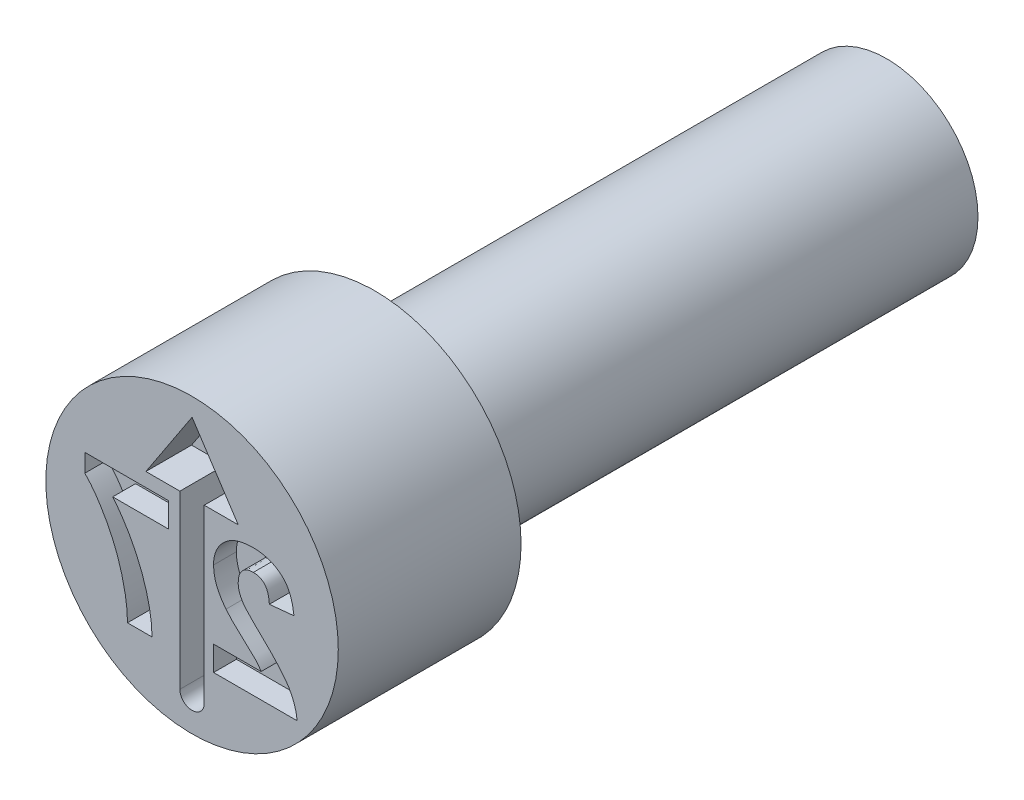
ISO-10303-21;
HEADER;
FILE_DESCRIPTION(('STEP AP214'),'2;1');
FILE_NAME('part.step','',(''),(''),'','','');
FILE_SCHEMA(('AUTOMOTIVE_DESIGN { 1 0 10303 214 1 1 1 1 }'));
ENDSEC;
DATA;
#1=APPLICATION_CONTEXT('core data for automotive mechanical design processes');
#2=APPLICATION_PROTOCOL_DEFINITION('international standard','automotive_design',2000,#1);
#3=PRODUCT_CONTEXT('',#1,'mechanical');
#4=PRODUCT('Part','Part','',(#3));
#5=PRODUCT_RELATED_PRODUCT_CATEGORY('part','',(#4));
#6=PRODUCT_DEFINITION_FORMATION('','',#4);
#7=PRODUCT_DEFINITION_CONTEXT('part definition',#1,'design');
#8=PRODUCT_DEFINITION('design','',#6,#7);
#9=PRODUCT_DEFINITION_SHAPE('','',#8);
#10=(LENGTH_UNIT() NAMED_UNIT(*) SI_UNIT(.MILLI.,.METRE.));
#11=(NAMED_UNIT(*) PLANE_ANGLE_UNIT() SI_UNIT($,.RADIAN.));
#12=(NAMED_UNIT(*) SI_UNIT($,.STERADIAN.) SOLID_ANGLE_UNIT());
#13=UNCERTAINTY_MEASURE_WITH_UNIT(LENGTH_MEASURE(1.E-05),#10,'distance_accuracy_value','');
#14=(GEOMETRIC_REPRESENTATION_CONTEXT(3) GLOBAL_UNCERTAINTY_ASSIGNED_CONTEXT((#13)) GLOBAL_UNIT_ASSIGNED_CONTEXT((#10,
#11,#12)) REPRESENTATION_CONTEXT('',''));
#15=CARTESIAN_POINT('',(0.,0.,0.));
#16=DIRECTION('',(0.,0.,1.));
#17=DIRECTION('',(1.,0.,0.));
#18=AXIS2_PLACEMENT_3D('',#15,#16,#17);
#19=CARTESIAN_POINT('',(0.,0.499999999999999,-1.));
#20=DIRECTION('',(0.,0.,1.));
#21=DIRECTION('',(1.,0.,0.));
#22=AXIS2_PLACEMENT_3D('',#19,#20,#21);
#23=PLANE('',#22);
#24=CARTESIAN_POINT('',(0.,0.,-1.));
#25=DIRECTION('',(0.,0.,1.));
#26=DIRECTION('',(1.,0.,0.));
#27=AXIS2_PLACEMENT_3D('',#24,#25,#26);
#28=CIRCLE('',#27,0.8);
#29=CARTESIAN_POINT('',(0.8,0.,-1.));
#30=VERTEX_POINT('',#29);
#31=EDGE_CURVE('E11',#30,#30,#28,.T.);
#32=ORIENTED_EDGE('',*,*,#31,.F.);
#33=EDGE_LOOP('',(#32));
#34=FACE_BOUND('',#33,.T.);
#35=CARTESIAN_POINT('',(0.,0.,-1.));
#36=DIRECTION('',(0.,0.,1.));
#37=DIRECTION('',(1.,0.,0.));
#38=AXIS2_PLACEMENT_3D('',#35,#36,#37);
#39=CIRCLE('',#38,0.499999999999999);
#40=CARTESIAN_POINT('',(0.499999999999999,0.,-1.));
#41=VERTEX_POINT('',#40);
#42=EDGE_CURVE('E462',#41,#41,#39,.T.);
#43=ORIENTED_EDGE('',*,*,#42,.T.);
#44=EDGE_LOOP('',(#43));
#45=FACE_BOUND('',#44,.T.);
#46=ADVANCED_FACE('F39',(#34,#45),#23,.F.);
#47=CARTESIAN_POINT('',(0.,0.,-0.403888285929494));
#48=DIRECTION('',(0.,0.,1.));
#49=DIRECTION('',(1.,0.,0.));
#50=AXIS2_PLACEMENT_3D('',#47,#48,#49);
#51=CYLINDRICAL_SURFACE('',#50,0.8);
#52=CARTESIAN_POINT('',(0.,0.,0.));
#53=DIRECTION('',(0.,0.,1.));
#54=DIRECTION('',(1.,0.,0.));
#55=AXIS2_PLACEMENT_3D('',#52,#53,#54);
#56=CIRCLE('',#55,0.8);
#57=CARTESIAN_POINT('',(0.8,0.,0.));
#58=VERTEX_POINT('',#57);
#59=EDGE_CURVE('E46',#58,#58,#56,.T.);
#60=ORIENTED_EDGE('',*,*,#59,.F.);
#61=EDGE_LOOP('',(#60));
#62=FACE_BOUND('',#61,.T.);
#63=ORIENTED_EDGE('',*,*,#31,.T.);
#64=EDGE_LOOP('',(#63));
#65=FACE_BOUND('',#64,.T.);
#66=ADVANCED_FACE('F484',(#62,#65),#51,.T.);
#67=CARTESIAN_POINT('',(0.,0.8,0.));
#68=DIRECTION('',(0.,0.,-1.));
#69=DIRECTION('',(-1.,0.,0.));
#70=AXIS2_PLACEMENT_3D('',#67,#68,#69);
#71=PLANE('',#70);
#72=DIRECTION('',(0.,1.,0.));
#73=VECTOR('',#72,1.);
#74=CARTESIAN_POINT('',(-0.128945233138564,0.106410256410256,0.));
#75=LINE('',#74,#73);
#76=CARTESIAN_POINT('',(-0.128945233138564,0.106410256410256,0.));
#77=VERTEX_POINT('',#76);
#78=CARTESIAN_POINT('',(-0.128945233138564,0.241025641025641,0.));
#79=VERTEX_POINT('',#78);
#80=EDGE_CURVE('E708',#77,#79,#75,.T.);
#81=ORIENTED_EDGE('',*,*,#80,.F.);
#82=DIRECTION('',(1.,0.,0.));
#83=VECTOR('',#82,1.);
#84=CARTESIAN_POINT('',(-0.434213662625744,0.106410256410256,0.));
#85=LINE('',#84,#83);
#86=CARTESIAN_POINT('',(-0.434213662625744,0.106410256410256,0.));
#87=VERTEX_POINT('',#86);
#88=EDGE_CURVE('E53',#87,#77,#85,.T.);
#89=ORIENTED_EDGE('',*,*,#88,.F.);
#90=CARTESIAN_POINT('',(-0.218688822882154,-0.45,0.));
#91=CARTESIAN_POINT('',(-0.219138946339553,-0.438074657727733,0.));
#92=CARTESIAN_POINT('',(-0.22004419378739,-0.414091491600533,0.));
#93=CARTESIAN_POINT('',(-0.223431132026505,-0.378093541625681,0.));
#94=CARTESIAN_POINT('',(-0.228750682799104,-0.341961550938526,0.));
#95=CARTESIAN_POINT('',(-0.235357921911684,-0.305612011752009,0.));
#96=CARTESIAN_POINT('',(-0.244081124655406,-0.269133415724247,0.));
#97=CARTESIAN_POINT('',(-0.254036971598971,-0.23239063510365,0.));
#98=CARTESIAN_POINT('',(-0.266096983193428,-0.195579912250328,0.));
#99=CARTESIAN_POINT('',(-0.279615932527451,-0.15877163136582,0.));
#100=CARTESIAN_POINT('',(-0.294540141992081,-0.122315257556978,0.));
#101=CARTESIAN_POINT('',(-0.310805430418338,-0.0866629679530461,0.));
#102=CARTESIAN_POINT('',(-0.328369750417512,-0.0520371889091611,0.));
#103=CARTESIAN_POINT('',(-0.347004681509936,-0.0183162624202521,0.));
#104=CARTESIAN_POINT('',(-0.366927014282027,0.0143913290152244,0.));
#105=CARTESIAN_POINT('',(-0.388151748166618,0.0460500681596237,0.));
#106=CARTESIAN_POINT('',(-0.410377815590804,0.0768889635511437,0.));
#107=CARTESIAN_POINT('',(-0.426269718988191,0.0965714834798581,0.));
#108=CARTESIAN_POINT('',(-0.434213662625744,0.106410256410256,0.));
#109=B_SPLINE_CURVE_WITH_KNOTS('',3,(#90,#91,#92,#93,#94,#95,#96,#97,#98,#99,#100,#101,#102,
#103,#104,#105,#106,#107,#108),.UNSPECIFIED.,.F.,.F.,(4,1,1,1,1,1,1,1,1,1,1,1,1,1,1,1,4),(0.,
0.0589531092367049,0.118561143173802,0.178522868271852,0.239353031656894,0.301026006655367,
0.363773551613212,0.427382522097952,0.492333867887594,0.557475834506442,0.621960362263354,
0.685889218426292,0.749254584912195,0.812267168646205,0.875035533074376,0.937533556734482,1.),.UNSPECIFIED.);
#110=CARTESIAN_POINT('',(-0.218688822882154,-0.45,0.));
#111=VERTEX_POINT('',#110);
#112=EDGE_CURVE('E238',#111,#87,#109,.T.);
#113=ORIENTED_EDGE('',*,*,#112,.F.);
#114=DIRECTION('',(1.,0.,0.));
#115=VECTOR('',#114,1.);
#116=CARTESIAN_POINT('',(-0.353304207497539,-0.45,0.));
#117=LINE('',#116,#115);
#118=CARTESIAN_POINT('',(-0.353304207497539,-0.45,0.));
#119=VERTEX_POINT('',#118);
#120=EDGE_CURVE('E241',#119,#111,#117,.T.);
#121=ORIENTED_EDGE('',*,*,#120,.F.);
#122=CARTESIAN_POINT('',(-0.586637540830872,0.142307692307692,0.));
#123=CARTESIAN_POINT('',(-0.581862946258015,0.137449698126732,0.));
#124=CARTESIAN_POINT('',(-0.572047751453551,0.127463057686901,0.));
#125=CARTESIAN_POINT('',(-0.557988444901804,0.111118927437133,0.));
#126=CARTESIAN_POINT('',(-0.543720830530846,0.0933826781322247,0.));
#127=CARTESIAN_POINT('',(-0.529543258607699,0.0740153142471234,0.));
#128=CARTESIAN_POINT('',(-0.515015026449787,0.0533227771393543,0.));
#129=CARTESIAN_POINT('',(-0.500774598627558,0.0309084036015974,0.));
#130=CARTESIAN_POINT('',(-0.486331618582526,0.00706297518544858,0.));
#131=CARTESIAN_POINT('',(-0.466886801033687,-0.0266664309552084,0.));
#132=CARTESIAN_POINT('',(-0.444158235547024,-0.0707274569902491,0.));
#133=CARTESIAN_POINT('',(-0.42011261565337,-0.125497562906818,0.));
#134=CARTESIAN_POINT('',(-0.399626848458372,-0.18194970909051,0.));
#135=CARTESIAN_POINT('',(-0.385599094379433,-0.230051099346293,0.));
#136=CARTESIAN_POINT('',(-0.376121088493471,-0.26860428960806,0.));
#137=CARTESIAN_POINT('',(-0.369928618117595,-0.296795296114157,0.));
#138=CARTESIAN_POINT('',(-0.364715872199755,-0.324192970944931,0.));
#139=CARTESIAN_POINT('',(-0.360475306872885,-0.350845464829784,0.));
#140=CARTESIAN_POINT('',(-0.357310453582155,-0.376764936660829,0.));
#141=CARTESIAN_POINT('',(-0.354809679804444,-0.401861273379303,0.));
#142=CARTESIAN_POINT('',(-0.353575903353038,-0.426195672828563,0.));
#143=CARTESIAN_POINT('',(-0.353393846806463,-0.442146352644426,0.));
#144=CARTESIAN_POINT('',(-0.353304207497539,-0.45,0.));
#145=B_SPLINE_CURVE_WITH_KNOTS('',3,(#122,#123,#124,#125,#126,#127,#128,#129,#130,#131,#132,
#133,#134,#135,#136,#137,#138,#139,#140,#141,#142,#143,#144),.UNSPECIFIED.,.F.,.F.,(4,1,1,1,1,1,
1,1,1,1,1,1,1,1,1,1,1,1,1,1,4),(0.,0.0314272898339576,0.0646054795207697,0.0994393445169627,
0.136456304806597,0.175351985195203,0.216100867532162,0.258977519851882,0.304007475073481,
0.395756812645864,0.487615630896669,0.579873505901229,0.672707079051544,0.718694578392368,
0.76307923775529,0.80589344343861,0.847386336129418,0.88760014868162,0.926386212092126,
0.963754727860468,1.),.UNSPECIFIED.);
#146=CARTESIAN_POINT('',(-0.586637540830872,0.142307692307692,0.));
#147=VERTEX_POINT('',#146);
#148=EDGE_CURVE('E694',#147,#119,#145,.T.);
#149=ORIENTED_EDGE('',*,*,#148,.F.);
#150=DIRECTION('',(0.,-1.,0.));
#151=VECTOR('',#150,1.);
#152=CARTESIAN_POINT('',(-0.586637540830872,0.241025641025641,0.));
#153=LINE('',#152,#151);
#154=CARTESIAN_POINT('',(-0.586637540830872,0.241025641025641,0.));
#155=VERTEX_POINT('',#154);
#156=EDGE_CURVE('E699',#155,#147,#153,.T.);
#157=ORIENTED_EDGE('',*,*,#156,.F.);
#158=DIRECTION('',(-1.,0.,0.));
#159=VECTOR('',#158,1.);
#160=CARTESIAN_POINT('',(-0.128945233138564,0.241025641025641,0.));
#161=LINE('',#160,#159);
#162=EDGE_CURVE('E705',#79,#155,#161,.T.);
#163=ORIENTED_EDGE('',*,*,#162,.F.);
#164=EDGE_LOOP('',(#81,#89,#113,#121,#149,#157,#163));
#165=FACE_BOUND('',#164,.T.);
#166=DIRECTION('',(0.,-1.,0.));
#167=VECTOR('',#166,1.);
#168=CARTESIAN_POINT('',(0.117670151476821,-0.315384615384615,0.));
#169=LINE('',#168,#167);
#170=CARTESIAN_POINT('',(0.117670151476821,-0.315384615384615,0.));
#171=VERTEX_POINT('',#170);
#172=CARTESIAN_POINT('',(0.117670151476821,-0.45,0.));
#173=VERTEX_POINT('',#172);
#174=EDGE_CURVE('E310',#171,#173,#169,.T.);
#175=ORIENTED_EDGE('',*,*,#174,.F.);
#176=DIRECTION('',(-1.,0.,0.));
#177=VECTOR('',#176,1.);
#178=CARTESIAN_POINT('',(0.377786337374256,-0.315384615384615,0.));
#179=LINE('',#178,#177);
#180=CARTESIAN_POINT('',(0.377786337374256,-0.315384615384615,0.));
#181=VERTEX_POINT('',#180);
#182=EDGE_CURVE('E61',#181,#171,#179,.T.);
#183=ORIENTED_EDGE('',*,*,#182,.F.);
#184=CARTESIAN_POINT('',(0.18553874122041,-0.115985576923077,0.));
#185=CARTESIAN_POINT('',(0.187667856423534,-0.118667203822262,0.));
#186=CARTESIAN_POINT('',(0.19222792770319,-0.124410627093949,0.));
#187=CARTESIAN_POINT('',(0.19998580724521,-0.133217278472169,0.));
#188=CARTESIAN_POINT('',(0.208976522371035,-0.142836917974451,0.));
#189=CARTESIAN_POINT('',(0.219073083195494,-0.153449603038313,0.));
#190=CARTESIAN_POINT('',(0.230608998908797,-0.164679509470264,0.));
#191=CARTESIAN_POINT('',(0.243169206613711,-0.17699626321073,0.));
#192=CARTESIAN_POINT('',(0.257306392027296,-0.189769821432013,0.));
#193=CARTESIAN_POINT('',(0.271949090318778,-0.203318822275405,0.));
#194=CARTESIAN_POINT('',(0.286655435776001,-0.216505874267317,0.));
#195=CARTESIAN_POINT('',(0.300172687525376,-0.229030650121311,0.));
#196=CARTESIAN_POINT('',(0.312450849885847,-0.240112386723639,0.));
#197=CARTESIAN_POINT('',(0.32291810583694,-0.250362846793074,0.));
#198=CARTESIAN_POINT('',(0.332190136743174,-0.25908244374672,0.));
#199=CARTESIAN_POINT('',(0.339932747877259,-0.266718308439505,0.));
#200=CARTESIAN_POINT('',(0.346290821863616,-0.27308558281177,0.));
#201=CARTESIAN_POINT('',(0.35505183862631,-0.283010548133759,0.));
#202=CARTESIAN_POINT('',(0.366199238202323,-0.296434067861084,0.));
#203=CARTESIAN_POINT('',(0.374041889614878,-0.309260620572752,0.));
#204=CARTESIAN_POINT('',(0.377786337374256,-0.315384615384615,0.));
#205=B_SPLINE_CURVE_WITH_KNOTS('',3,(#184,#185,#186,#187,#188,#189,#190,#191,#192,#193,#194,
#195,#196,#197,#198,#199,#200,#201,#202,#203,#204),.UNSPECIFIED.,.F.,.F.,(4,1,1,1,1,1,1,1,1,1,1,
1,1,1,1,1,1,1,4),(0.,0.0369753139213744,0.0791925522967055,0.126700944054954,0.179184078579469,
0.237368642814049,0.300558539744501,0.369153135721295,0.443112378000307,0.516018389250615,
0.582473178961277,0.642136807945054,0.694619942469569,0.740679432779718,0.779589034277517,
0.812073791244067,0.837814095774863,0.922564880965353,1.),.UNSPECIFIED.);
#206=CARTESIAN_POINT('',(0.18553874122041,-0.115985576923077,0.));
#207=VERTEX_POINT('',#206);
#208=EDGE_CURVE('E381',#207,#181,#205,.T.);
#209=ORIENTED_EDGE('',*,*,#208,.F.);
#210=CARTESIAN_POINT('',(0.117670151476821,0.0595753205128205,0.));
#211=CARTESIAN_POINT('',(0.117841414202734,0.0519449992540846,0.));
#212=CARTESIAN_POINT('',(0.118181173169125,0.0368076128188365,0.));
#213=CARTESIAN_POINT('',(0.121434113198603,0.014430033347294,0.));
#214=CARTESIAN_POINT('',(0.126403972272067,-0.00743152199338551,0.));
#215=CARTESIAN_POINT('',(0.133749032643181,-0.0288304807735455,0.));
#216=CARTESIAN_POINT('',(0.143059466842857,-0.0502801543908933,0.));
#217=CARTESIAN_POINT('',(0.155060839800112,-0.0718286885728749,0.));
#218=CARTESIAN_POINT('',(0.168995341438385,-0.0941259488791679,0.));
#219=CARTESIAN_POINT('',(0.179905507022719,-0.108542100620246,0.));
#220=CARTESIAN_POINT('',(0.18553874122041,-0.115985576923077,0.));
#221=B_SPLINE_CURVE_WITH_KNOTS('',3,(#210,#211,#212,#213,#214,#215,#216,#217,#218,#219,#220),
.UNSPECIFIED.,.F.,.F.,(4,1,1,1,1,1,1,1,4),(0.,0.119176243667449,0.236427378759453,
0.352663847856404,0.469086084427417,0.589462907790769,0.717601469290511,0.854189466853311,1.),.UNSPECIFIED.);
#222=CARTESIAN_POINT('',(0.117670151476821,0.0595753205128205,0.));
#223=VERTEX_POINT('',#222);
#224=EDGE_CURVE('E373',#223,#207,#221,.T.);
#225=ORIENTED_EDGE('',*,*,#224,.F.);
#226=CARTESIAN_POINT('',(0.332493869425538,0.25,0.));
#227=CARTESIAN_POINT('',(0.324354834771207,0.24984357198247,0.));
#228=CARTESIAN_POINT('',(0.30850304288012,0.249538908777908,0.));
#229=CARTESIAN_POINT('',(0.285362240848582,0.247022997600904,0.));
#230=CARTESIAN_POINT('',(0.263623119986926,0.242636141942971,0.));
#231=CARTESIAN_POINT('',(0.243095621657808,0.236825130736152,0.));
#232=CARTESIAN_POINT('',(0.223990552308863,0.229067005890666,0.));
#233=CARTESIAN_POINT('',(0.206148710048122,0.219687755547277,0.));
#234=CARTESIAN_POINT('',(0.189850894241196,0.208331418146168,0.));
#235=CARTESIAN_POINT('',(0.174854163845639,0.195617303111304,0.));
#236=CARTESIAN_POINT('',(0.161448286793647,0.18163589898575,0.));
#237=CARTESIAN_POINT('',(0.149705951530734,0.166722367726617,0.));
#238=CARTESIAN_POINT('',(0.139868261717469,0.150887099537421,0.));
#239=CARTESIAN_POINT('',(0.131612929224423,0.134323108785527,0.));
#240=CARTESIAN_POINT('',(0.125483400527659,0.116763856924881,0.));
#241=CARTESIAN_POINT('',(0.121017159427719,0.0984521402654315,0.));
#242=CARTESIAN_POINT('',(0.118055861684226,0.0793025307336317,0.));
#243=CARTESIAN_POINT('',(0.117800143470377,0.0662237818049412,0.));
#244=CARTESIAN_POINT('',(0.117670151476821,0.0595753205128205,0.));
#245=B_SPLINE_CURVE_WITH_KNOTS('',3,(#226,#227,#228,#229,#230,#231,#232,#233,#234,#235,#236,
#237,#238,#239,#240,#241,#242,#243,#244),.UNSPECIFIED.,.F.,.F.,(4,1,1,1,1,1,1,1,1,1,1,1,1,1,1,1,
4),(0.,0.0756723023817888,0.147381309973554,0.216084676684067,0.28169803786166,
0.345459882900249,0.407485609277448,0.46873129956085,0.529782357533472,0.590032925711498,
0.648548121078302,0.70595351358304,0.763101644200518,0.820289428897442,0.878479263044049,
0.938226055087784,1.),.UNSPECIFIED.);
#246=CARTESIAN_POINT('',(0.332493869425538,0.25,0.));
#247=VERTEX_POINT('',#246);
#248=EDGE_CURVE('E365',#247,#223,#245,.T.);
#249=ORIENTED_EDGE('',*,*,#248,.F.);
#250=CARTESIAN_POINT('',(0.55741374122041,0.0388221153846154,0.));
#251=CARTESIAN_POINT('',(0.556331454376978,0.047910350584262,0.));
#252=CARTESIAN_POINT('',(0.554233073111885,0.0655309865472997,0.));
#253=CARTESIAN_POINT('',(0.548996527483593,0.0908402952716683,0.));
#254=CARTESIAN_POINT('',(0.542364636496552,0.114189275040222,0.));
#255=CARTESIAN_POINT('',(0.534021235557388,0.135534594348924,0.));
#256=CARTESIAN_POINT('',(0.524311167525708,0.155011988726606,0.));
#257=CARTESIAN_POINT('',(0.512739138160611,0.172329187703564,0.));
#258=CARTESIAN_POINT('',(0.499709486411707,0.187678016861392,0.));
#259=CARTESIAN_POINT('',(0.485210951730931,0.201050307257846,0.));
#260=CARTESIAN_POINT('',(0.469335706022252,0.212488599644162,0.));
#261=CARTESIAN_POINT('',(0.452677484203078,0.222699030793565,0.));
#262=CARTESIAN_POINT('',(0.434910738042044,0.231074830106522,0.));
#263=CARTESIAN_POINT('',(0.416231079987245,0.237977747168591,0.));
#264=CARTESIAN_POINT('',(0.396646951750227,0.243494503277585,0.));
#265=CARTESIAN_POINT('',(0.376067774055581,0.247142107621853,0.));
#266=CARTESIAN_POINT('',(0.354620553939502,0.24970784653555,0.));
#267=CARTESIAN_POINT('',(0.339980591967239,0.24990114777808,0.));
#268=CARTESIAN_POINT('',(0.332493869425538,0.25,0.));
#269=B_SPLINE_CURVE_WITH_KNOTS('',3,(#250,#251,#252,#253,#254,#255,#256,#257,#258,#259,#260,
#261,#262,#263,#264,#265,#266,#267,#268),.UNSPECIFIED.,.F.,.F.,(4,1,1,1,1,1,1,1,1,1,1,1,1,1,1,1,
4),(0.,0.0794357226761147,0.154013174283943,0.224141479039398,0.289934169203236,
0.352732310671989,0.41272577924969,0.470302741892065,0.527168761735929,0.583502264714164,
0.639948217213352,0.696584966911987,0.753726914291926,0.812707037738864,0.872963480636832,
0.93503486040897,1.),.UNSPECIFIED.);
#270=CARTESIAN_POINT('',(0.55741374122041,0.0388221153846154,0.));
#271=VERTEX_POINT('',#270);
#272=EDGE_CURVE('E360',#271,#247,#269,.T.);
#273=ORIENTED_EDGE('',*,*,#272,.F.);
#274=DIRECTION('',(0.995240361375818,0.097450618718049,0.));
#275=VECTOR('',#274,1.);
#276=CARTESIAN_POINT('',(0.422798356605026,0.0256410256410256,0.));
#277=LINE('',#276,#275);
#278=CARTESIAN_POINT('',(0.422798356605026,0.0256410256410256,0.));
#279=VERTEX_POINT('',#278);
#280=EDGE_CURVE('E354',#279,#271,#277,.T.);
#281=ORIENTED_EDGE('',*,*,#280,.F.);
#282=CARTESIAN_POINT('',(0.335298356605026,0.133333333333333,0.));
#283=CARTESIAN_POINT('',(0.341403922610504,0.133056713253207,0.));
#284=CARTESIAN_POINT('',(0.353198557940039,0.132522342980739,0.));
#285=CARTESIAN_POINT('',(0.369961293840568,0.12785415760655,0.));
#286=CARTESIAN_POINT('',(0.384625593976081,0.119773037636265,0.));
#287=CARTESIAN_POINT('',(0.395076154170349,0.110563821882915,0.));
#288=CARTESIAN_POINT('',(0.402136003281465,0.101608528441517,0.));
#289=CARTESIAN_POINT('',(0.406946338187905,0.0938045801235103,0.));
#290=CARTESIAN_POINT('',(0.411092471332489,0.0849369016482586,0.));
#291=CARTESIAN_POINT('',(0.414766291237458,0.0751053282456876,0.));
#292=CARTESIAN_POINT('',(0.417668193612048,0.0641972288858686,0.));
#293=CARTESIAN_POINT('',(0.420005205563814,0.0522956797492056,0.));
#294=CARTESIAN_POINT('',(0.421888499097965,0.039336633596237,0.));
#295=CARTESIAN_POINT('',(0.422487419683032,0.0303213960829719,0.));
#296=CARTESIAN_POINT('',(0.422798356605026,0.0256410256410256,0.));
#297=B_SPLINE_CURVE_WITH_KNOTS('',3,(#282,#283,#284,#285,#286,#287,#288,#289,#290,#291,#292,
#293,#294,#295,#296),.UNSPECIFIED.,.F.,.F.,(4,1,1,1,1,1,1,1,1,1,1,1,4),(0.,0.116899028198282,
0.225823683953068,0.330086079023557,0.435451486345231,0.490306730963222,0.54824405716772,
0.610766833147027,0.677675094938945,0.749188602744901,0.826858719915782,0.910111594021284,1.),.UNSPECIFIED.);
#298=CARTESIAN_POINT('',(0.335298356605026,0.133333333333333,0.));
#299=VERTEX_POINT('',#298);
#300=EDGE_CURVE('E346',#299,#279,#297,.T.);
#301=ORIENTED_EDGE('',*,*,#300,.F.);
#302=CARTESIAN_POINT('',(0.252285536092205,0.0414863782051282,0.));
#303=CARTESIAN_POINT('',(0.252537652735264,0.048470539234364,0.));
#304=CARTESIAN_POINT('',(0.253014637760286,0.0616840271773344,0.));
#305=CARTESIAN_POINT('',(0.257014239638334,0.0803307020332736,0.));
#306=CARTESIAN_POINT('',(0.264106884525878,0.0963601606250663,0.));
#307=CARTESIAN_POINT('',(0.273872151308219,0.109821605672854,0.));
#308=CARTESIAN_POINT('',(0.286220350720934,0.120368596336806,0.));
#309=CARTESIAN_POINT('',(0.300655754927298,0.128161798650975,0.));
#310=CARTESIAN_POINT('',(0.31738967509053,0.132470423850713,0.));
#311=CARTESIAN_POINT('',(0.329151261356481,0.1330371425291,0.));
#312=CARTESIAN_POINT('',(0.335298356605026,0.133333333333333,0.));
#313=B_SPLINE_CURVE_WITH_KNOTS('',3,(#302,#303,#304,#305,#306,#307,#308,#309,#310,#311,#312),
.UNSPECIFIED.,.F.,.F.,(4,1,1,1,1,1,1,1,4),(0.,0.149140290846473,0.282161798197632,
0.40465570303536,0.521109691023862,0.634416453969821,0.748796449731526,0.868710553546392,1.),.UNSPECIFIED.);
#314=CARTESIAN_POINT('',(0.252285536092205,0.0414863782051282,0.));
#315=VERTEX_POINT('',#314);
#316=EDGE_CURVE('E338',#315,#299,#313,.T.);
#317=ORIENTED_EDGE('',*,*,#316,.F.);
#318=CARTESIAN_POINT('',(0.278928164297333,-0.0394230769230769,0.));
#319=CARTESIAN_POINT('',(0.274875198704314,-0.0326906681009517,0.));
#320=CARTESIAN_POINT('',(0.267057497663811,-0.0197046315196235,0.));
#321=CARTESIAN_POINT('',(0.258484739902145,0.000716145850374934,0.));
#322=CARTESIAN_POINT('',(0.253339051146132,0.0211327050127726,0.));
#323=CARTESIAN_POINT('',(0.252632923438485,0.0347749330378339,0.));
#324=CARTESIAN_POINT('',(0.252285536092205,0.0414863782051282,0.));
#325=B_SPLINE_CURVE_WITH_KNOTS('',3,(#318,#319,#320,#321,#322,#323,#324),.UNSPECIFIED.,.F.,.F.,
(4,1,1,1,4),(0.,0.272795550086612,0.526191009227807,0.766904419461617,1.),.UNSPECIFIED.);
#326=CARTESIAN_POINT('',(0.278928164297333,-0.0394230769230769,0.));
#327=VERTEX_POINT('',#326);
#328=EDGE_CURVE('E330',#327,#315,#325,.T.);
#329=ORIENTED_EDGE('',*,*,#328,.F.);
#330=CARTESIAN_POINT('',(0.386059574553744,-0.15244391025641,0.));
#331=CARTESIAN_POINT('',(0.379138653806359,-0.145763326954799,0.));
#332=CARTESIAN_POINT('',(0.365963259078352,-0.133045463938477,0.));
#333=CARTESIAN_POINT('',(0.347201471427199,-0.114833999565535,0.));
#334=CARTESIAN_POINT('',(0.330707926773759,-0.0980924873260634,0.));
#335=CARTESIAN_POINT('',(0.316137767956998,-0.0832547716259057,0.));
#336=CARTESIAN_POINT('',(0.303827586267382,-0.0699430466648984,0.));
#337=CARTESIAN_POINT('',(0.293615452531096,-0.0583663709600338,0.));
#338=CARTESIAN_POINT('',(0.285372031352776,-0.048477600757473,0.));
#339=CARTESIAN_POINT('',(0.280907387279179,-0.0422041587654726,0.));
#340=CARTESIAN_POINT('',(0.278928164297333,-0.0394230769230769,0.));
#341=B_SPLINE_CURVE_WITH_KNOTS('',3,(#330,#331,#332,#333,#334,#335,#336,#337,#338,#339,#340),
.UNSPECIFIED.,.F.,.F.,(4,1,1,1,1,1,1,1,4),(0.,0.18509006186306,0.352356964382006,
0.503079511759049,0.637279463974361,0.752473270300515,0.851885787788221,0.934339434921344,1.),.UNSPECIFIED.);
#342=CARTESIAN_POINT('',(0.386059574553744,-0.15244391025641,0.));
#343=VERTEX_POINT('',#342);
#344=EDGE_CURVE('E322',#343,#327,#341,.T.);
#345=ORIENTED_EDGE('',*,*,#344,.F.);
#346=CARTESIAN_POINT('',(0.575362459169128,-0.45,0.));
#347=CARTESIAN_POINT('',(0.573812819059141,-0.438495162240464,0.));
#348=CARTESIAN_POINT('',(0.570714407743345,-0.415491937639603,0.));
#349=CARTESIAN_POINT('',(0.56113522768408,-0.381890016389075,0.));
#350=CARTESIAN_POINT('',(0.548350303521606,-0.349100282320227,0.));
#351=CARTESIAN_POINT('',(0.534474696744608,-0.322417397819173,0.));
#352=CARTESIAN_POINT('',(0.520673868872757,-0.300938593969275,0.));
#353=CARTESIAN_POINT('',(0.508152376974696,-0.283338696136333,0.));
#354=CARTESIAN_POINT('',(0.493214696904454,-0.264613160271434,0.));
#355=CARTESIAN_POINT('',(0.476077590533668,-0.24461081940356,0.));
#356=CARTESIAN_POINT('',(0.456835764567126,-0.223269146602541,0.));
#357=CARTESIAN_POINT('',(0.43534566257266,-0.200667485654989,0.));
#358=CARTESIAN_POINT('',(0.411504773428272,-0.176914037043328,0.));
#359=CARTESIAN_POINT('',(0.394732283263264,-0.160784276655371,0.));
#360=CARTESIAN_POINT('',(0.386059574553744,-0.15244391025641,0.));
#361=B_SPLINE_CURVE_WITH_KNOTS('',3,(#346,#347,#348,#349,#350,#351,#352,#353,#354,#355,#356,
#357,#358,#359,#360),.UNSPECIFIED.,.F.,.F.,(4,1,1,1,1,1,1,1,1,1,1,1,4),(0.,0.0963574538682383,
0.192660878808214,0.289454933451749,0.388479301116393,0.441921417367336,0.501521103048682,
0.567882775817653,0.640891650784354,0.72037065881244,0.806636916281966,0.900015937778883,1.),.UNSPECIFIED.);
#362=CARTESIAN_POINT('',(0.575362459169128,-0.45,0.));
#363=VERTEX_POINT('',#362);
#364=EDGE_CURVE('E317',#363,#343,#361,.T.);
#365=ORIENTED_EDGE('',*,*,#364,.F.);
#366=DIRECTION('',(1.,0.,0.));
#367=VECTOR('',#366,1.);
#368=CARTESIAN_POINT('',(0.117670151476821,-0.45,0.));
#369=LINE('',#368,#367);
#370=EDGE_CURVE('E314',#173,#363,#369,.T.);
#371=ORIENTED_EDGE('',*,*,#370,.F.);
#372=EDGE_LOOP('',(#175,#183,#209,#225,#249,#273,#281,#301,#317,#329,#345,#365,#371));
#373=FACE_BOUND('',#372,.T.);
#374=DIRECTION('',(0.,1.,0.));
#375=VECTOR('',#374,1.);
#376=CARTESIAN_POINT('',(0.0666655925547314,0.31722300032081,0.));
#377=LINE('',#376,#375);
#378=CARTESIAN_POINT('',(0.0666655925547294,-0.62165664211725,0.));
#379=VERTEX_POINT('',#378);
#380=CARTESIAN_POINT('',(0.0666655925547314,0.31722300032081,0.));
#381=VERTEX_POINT('',#380);
#382=EDGE_CURVE('E443',#379,#381,#377,.T.);
#383=ORIENTED_EDGE('',*,*,#382,.F.);
#384=CARTESIAN_POINT('',(0.,-0.62165664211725,0.));
#385=DIRECTION('',(0.,0.,1.));
#386=DIRECTION('',(1.,0.,0.));
#387=AXIS2_PLACEMENT_3D('',#384,#385,#386);
#388=CIRCLE('',#387,0.0666655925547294);
#389=CARTESIAN_POINT('',(-0.0666655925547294,-0.62165664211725,0.));
#390=VERTEX_POINT('',#389);
#391=EDGE_CURVE('E395',#390,#379,#388,.T.);
#392=ORIENTED_EDGE('',*,*,#391,.F.);
#393=DIRECTION('',(0.,-1.,0.));
#394=VECTOR('',#393,1.);
#395=CARTESIAN_POINT('',(-0.0666655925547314,0.31722300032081,0.));
#396=LINE('',#395,#394);
#397=CARTESIAN_POINT('',(-0.0666655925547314,0.31722300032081,0.));
#398=VERTEX_POINT('',#397);
#399=EDGE_CURVE('E423',#398,#390,#396,.T.);
#400=ORIENTED_EDGE('',*,*,#399,.F.);
#401=DIRECTION('',(1.,0.,0.));
#402=VECTOR('',#401,1.);
#403=CARTESIAN_POINT('',(-0.252671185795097,0.31722300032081,0.));
#404=LINE('',#403,#402);
#405=CARTESIAN_POINT('',(-0.252671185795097,0.31722300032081,0.));
#406=VERTEX_POINT('',#405);
#407=EDGE_CURVE('E455',#406,#398,#404,.T.);
#408=ORIENTED_EDGE('',*,*,#407,.F.);
#409=DIRECTION('',(-0.550159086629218,-0.835059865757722,0.));
#410=VECTOR('',#409,1.);
#411=CARTESIAN_POINT('',(0.,0.700740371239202,0.));
#412=LINE('',#411,#410);
#413=CARTESIAN_POINT('',(0.,0.700740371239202,0.));
#414=VERTEX_POINT('',#413);
#415=EDGE_CURVE('E452',#414,#406,#412,.T.);
#416=ORIENTED_EDGE('',*,*,#415,.F.);
#417=DIRECTION('',(-0.550159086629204,0.835059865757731,0.));
#418=VECTOR('',#417,1.);
#419=CARTESIAN_POINT('',(0.,0.700740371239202,0.));
#420=LINE('',#419,#418);
#421=CARTESIAN_POINT('',(0.252671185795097,0.31722300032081,0.));
#422=VERTEX_POINT('',#421);
#423=EDGE_CURVE('E449',#422,#414,#420,.T.);
#424=ORIENTED_EDGE('',*,*,#423,.F.);
#425=DIRECTION('',(1.,0.,0.));
#426=VECTOR('',#425,1.);
#427=CARTESIAN_POINT('',(0.252671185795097,0.31722300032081,0.));
#428=LINE('',#427,#426);
#429=EDGE_CURVE('E446',#381,#422,#428,.T.);
#430=ORIENTED_EDGE('',*,*,#429,.F.);
#431=EDGE_LOOP('',(#383,#392,#400,#408,#416,#424,#430));
#432=FACE_BOUND('',#431,.T.);
#433=ORIENTED_EDGE('',*,*,#59,.T.);
#434=EDGE_LOOP('',(#433));
#435=FACE_BOUND('',#434,.T.);
#436=ADVANCED_FACE('F482',(#165,#373,#432,#435),#71,.F.);
#437=CARTESIAN_POINT('',(0.,0.,-3.8));
#438=DIRECTION('',(0.,0.,1.));
#439=DIRECTION('',(1.,0.,0.));
#440=AXIS2_PLACEMENT_3D('',#437,#438,#439);
#441=PLANE('',#440);
#442=CARTESIAN_POINT('',(0.,0.,-3.8));
#443=DIRECTION('',(0.,0.,1.));
#444=DIRECTION('',(1.,0.,0.));
#445=AXIS2_PLACEMENT_3D('',#442,#443,#444);
#446=CIRCLE('',#445,0.499999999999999);
#447=CARTESIAN_POINT('',(0.499999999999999,0.,-3.8));
#448=VERTEX_POINT('',#447);
#449=EDGE_CURVE('E477',#448,#448,#446,.T.);
#450=ORIENTED_EDGE('',*,*,#449,.F.);
#451=EDGE_LOOP('',(#450));
#452=FACE_BOUND('',#451,.T.);
#453=ADVANCED_FACE('F497',(#452),#441,.F.);
#454=CARTESIAN_POINT('',(0.,0.,-0.403888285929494));
#455=DIRECTION('',(0.,0.,1.));
#456=DIRECTION('',(1.,0.,0.));
#457=AXIS2_PLACEMENT_3D('',#454,#455,#456);
#458=CYLINDRICAL_SURFACE('',#457,0.499999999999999);
#459=ORIENTED_EDGE('',*,*,#42,.F.);
#460=EDGE_LOOP('',(#459));
#461=FACE_BOUND('',#460,.T.);
#462=ORIENTED_EDGE('',*,*,#449,.T.);
#463=EDGE_LOOP('',(#462));
#464=FACE_BOUND('',#463,.T.);
#465=ADVANCED_FACE('F493',(#461,#464),#458,.T.);
#466=CARTESIAN_POINT('',(0.,-0.62165664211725,-0.25));
#467=DIRECTION('',(0.,0.,1.));
#468=DIRECTION('',(1.,0.,0.));
#469=AXIS2_PLACEMENT_3D('',#466,#467,#468);
#470=CYLINDRICAL_SURFACE('',#469,0.0666655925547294);
#471=ORIENTED_EDGE('',*,*,#391,.T.);
#472=DIRECTION('',(0.,0.,1.));
#473=VECTOR('',#472,1.);
#474=CARTESIAN_POINT('',(0.0666655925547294,-0.62165664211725,-0.25));
#475=LINE('',#474,#473);
#476=CARTESIAN_POINT('',(0.0666655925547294,-0.62165664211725,-0.25));
#477=VERTEX_POINT('',#476);
#478=EDGE_CURVE('E441',#477,#379,#475,.T.);
#479=ORIENTED_EDGE('',*,*,#478,.F.);
#480=CARTESIAN_POINT('',(0.,-0.62165664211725,-0.25));
#481=DIRECTION('',(0.,0.,1.));
#482=DIRECTION('',(1.,0.,0.));
#483=AXIS2_PLACEMENT_3D('',#480,#481,#482);
#484=CIRCLE('',#483,0.0666655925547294);
#485=CARTESIAN_POINT('',(-0.0666655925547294,-0.62165664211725,-0.25));
#486=VERTEX_POINT('',#485);
#487=EDGE_CURVE('E419',#486,#477,#484,.T.);
#488=ORIENTED_EDGE('',*,*,#487,.F.);
#489=DIRECTION('',(0.,0.,1.));
#490=VECTOR('',#489,1.);
#491=CARTESIAN_POINT('',(-0.0666655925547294,-0.62165664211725,-0.25));
#492=LINE('',#491,#490);
#493=EDGE_CURVE('E460',#486,#390,#492,.T.);
#494=ORIENTED_EDGE('',*,*,#493,.T.);
#495=EDGE_LOOP('',(#471,#479,#488,#494));
#496=FACE_BOUND('',#495,.T.);
#497=ADVANCED_FACE('F496',(#496),#470,.F.);
#498=CARTESIAN_POINT('',(-0.0666655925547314,0.31722300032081,-0.25));
#499=DIRECTION('',(-1.,0.,0.));
#500=DIRECTION('',(0.,-1.,0.));
#501=AXIS2_PLACEMENT_3D('',#498,#499,#500);
#502=PLANE('',#501);
#503=ORIENTED_EDGE('',*,*,#399,.T.);
#504=ORIENTED_EDGE('',*,*,#493,.F.);
#505=DIRECTION('',(0.,-1.,0.));
#506=VECTOR('',#505,1.);
#507=CARTESIAN_POINT('',(-0.0666655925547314,0.31722300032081,-0.25));
#508=LINE('',#507,#506);
#509=CARTESIAN_POINT('',(-0.0666655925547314,0.31722300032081,-0.25));
#510=VERTEX_POINT('',#509);
#511=EDGE_CURVE('E438',#510,#486,#508,.T.);
#512=ORIENTED_EDGE('',*,*,#511,.F.);
#513=DIRECTION('',(0.,0.,1.));
#514=VECTOR('',#513,1.);
#515=CARTESIAN_POINT('',(-0.0666655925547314,0.31722300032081,-0.25));
#516=LINE('',#515,#514);
#517=EDGE_CURVE('E463',#510,#398,#516,.T.);
#518=ORIENTED_EDGE('',*,*,#517,.T.);
#519=EDGE_LOOP('',(#503,#504,#512,#518));
#520=FACE_BOUND('',#519,.T.);
#521=ADVANCED_FACE('F511',(#520),#502,.F.);
#522=CARTESIAN_POINT('',(-0.252671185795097,0.31722300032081,-0.25));
#523=DIRECTION('',(0.,-1.,0.));
#524=DIRECTION('',(0.,0.,-1.));
#525=AXIS2_PLACEMENT_3D('',#522,#523,#524);
#526=PLANE('',#525);
#527=ORIENTED_EDGE('',*,*,#407,.T.);
#528=ORIENTED_EDGE('',*,*,#517,.F.);
#529=DIRECTION('',(1.,0.,0.));
#530=VECTOR('',#529,1.);
#531=CARTESIAN_POINT('',(-0.252671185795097,0.31722300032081,-0.25));
#532=LINE('',#531,#530);
#533=CARTESIAN_POINT('',(-0.252671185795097,0.31722300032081,-0.25));
#534=VERTEX_POINT('',#533);
#535=EDGE_CURVE('E435',#534,#510,#532,.T.);
#536=ORIENTED_EDGE('',*,*,#535,.F.);
#537=DIRECTION('',(0.,0.,1.));
#538=VECTOR('',#537,1.);
#539=CARTESIAN_POINT('',(-0.252671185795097,0.31722300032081,-0.25));
#540=LINE('',#539,#538);
#541=EDGE_CURVE('E465',#534,#406,#540,.T.);
#542=ORIENTED_EDGE('',*,*,#541,.T.);
#543=EDGE_LOOP('',(#527,#528,#536,#542));
#544=FACE_BOUND('',#543,.T.);
#545=ADVANCED_FACE('F529',(#544),#526,.F.);
#546=CARTESIAN_POINT('',(0.,0.700740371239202,-0.25));
#547=DIRECTION('',(-0.835059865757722,0.550159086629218,0.));
#548=DIRECTION('',(-0.550159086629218,-0.835059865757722,0.));
#549=AXIS2_PLACEMENT_3D('',#546,#547,#548);
#550=PLANE('',#549);
#551=ORIENTED_EDGE('',*,*,#415,.T.);
#552=ORIENTED_EDGE('',*,*,#541,.F.);
#553=DIRECTION('',(-0.550159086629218,-0.835059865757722,0.));
#554=VECTOR('',#553,1.);
#555=CARTESIAN_POINT('',(0.,0.700740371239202,-0.25));
#556=LINE('',#555,#554);
#557=CARTESIAN_POINT('',(0.,0.700740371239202,-0.25));
#558=VERTEX_POINT('',#557);
#559=EDGE_CURVE('E432',#558,#534,#556,.T.);
#560=ORIENTED_EDGE('',*,*,#559,.F.);
#561=DIRECTION('',(0.,0.,1.));
#562=VECTOR('',#561,1.);
#563=CARTESIAN_POINT('',(0.,0.700740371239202,-0.25));
#564=LINE('',#563,#562);
#565=EDGE_CURVE('E467',#558,#414,#564,.T.);
#566=ORIENTED_EDGE('',*,*,#565,.T.);
#567=EDGE_LOOP('',(#551,#552,#560,#566));
#568=FACE_BOUND('',#567,.T.);
#569=ADVANCED_FACE('F525',(#568),#550,.F.);
#570=CARTESIAN_POINT('',(0.,0.700740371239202,-0.25));
#571=DIRECTION('',(0.835059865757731,0.550159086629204,0.));
#572=DIRECTION('',(-0.550159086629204,0.835059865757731,0.));
#573=AXIS2_PLACEMENT_3D('',#570,#571,#572);
#574=PLANE('',#573);
#575=ORIENTED_EDGE('',*,*,#423,.T.);
#576=ORIENTED_EDGE('',*,*,#565,.F.);
#577=DIRECTION('',(-0.550159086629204,0.835059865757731,0.));
#578=VECTOR('',#577,1.);
#579=CARTESIAN_POINT('',(0.,0.700740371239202,-0.25));
#580=LINE('',#579,#578);
#581=CARTESIAN_POINT('',(0.252671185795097,0.31722300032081,-0.25));
#582=VERTEX_POINT('',#581);
#583=EDGE_CURVE('E429',#582,#558,#580,.T.);
#584=ORIENTED_EDGE('',*,*,#583,.F.);
#585=DIRECTION('',(0.,0.,1.));
#586=VECTOR('',#585,1.);
#587=CARTESIAN_POINT('',(0.252671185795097,0.31722300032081,-0.25));
#588=LINE('',#587,#586);
#589=EDGE_CURVE('E469',#582,#422,#588,.T.);
#590=ORIENTED_EDGE('',*,*,#589,.T.);
#591=EDGE_LOOP('',(#575,#576,#584,#590));
#592=FACE_BOUND('',#591,.T.);
#593=ADVANCED_FACE('F521',(#592),#574,.F.);
#594=CARTESIAN_POINT('',(0.252671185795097,0.31722300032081,-0.25));
#595=DIRECTION('',(0.,-1.,0.));
#596=DIRECTION('',(0.,0.,-1.));
#597=AXIS2_PLACEMENT_3D('',#594,#595,#596);
#598=PLANE('',#597);
#599=ORIENTED_EDGE('',*,*,#429,.T.);
#600=ORIENTED_EDGE('',*,*,#589,.F.);
#601=DIRECTION('',(1.,0.,0.));
#602=VECTOR('',#601,1.);
#603=CARTESIAN_POINT('',(0.252671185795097,0.31722300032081,-0.25));
#604=LINE('',#603,#602);
#605=CARTESIAN_POINT('',(0.0666655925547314,0.31722300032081,-0.25));
#606=VERTEX_POINT('',#605);
#607=EDGE_CURVE('E426',#606,#582,#604,.T.);
#608=ORIENTED_EDGE('',*,*,#607,.F.);
#609=DIRECTION('',(0.,0.,1.));
#610=VECTOR('',#609,1.);
#611=CARTESIAN_POINT('',(0.0666655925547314,0.31722300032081,-0.25));
#612=LINE('',#611,#610);
#613=EDGE_CURVE('E471',#606,#381,#612,.T.);
#614=ORIENTED_EDGE('',*,*,#613,.T.);
#615=EDGE_LOOP('',(#599,#600,#608,#614));
#616=FACE_BOUND('',#615,.T.);
#617=ADVANCED_FACE('F517',(#616),#598,.F.);
#618=CARTESIAN_POINT('',(0.0666655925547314,0.31722300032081,-0.25));
#619=DIRECTION('',(1.,0.,0.));
#620=DIRECTION('',(0.,1.,0.));
#621=AXIS2_PLACEMENT_3D('',#618,#619,#620);
#622=PLANE('',#621);
#623=ORIENTED_EDGE('',*,*,#382,.T.);
#624=ORIENTED_EDGE('',*,*,#613,.F.);
#625=DIRECTION('',(0.,1.,0.));
#626=VECTOR('',#625,1.);
#627=CARTESIAN_POINT('',(0.0666655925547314,0.31722300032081,-0.25));
#628=LINE('',#627,#626);
#629=EDGE_CURVE('E422',#477,#606,#628,.T.);
#630=ORIENTED_EDGE('',*,*,#629,.F.);
#631=ORIENTED_EDGE('',*,*,#478,.T.);
#632=EDGE_LOOP('',(#623,#624,#630,#631));
#633=FACE_BOUND('',#632,.T.);
#634=ADVANCED_FACE('F513',(#633),#622,.F.);
#635=CARTESIAN_POINT('',(0.,-0.62165664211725,-0.25));
#636=DIRECTION('',(0.,0.,1.));
#637=DIRECTION('',(1.,0.,0.));
#638=AXIS2_PLACEMENT_3D('',#635,#636,#637);
#639=PLANE('',#638);
#640=ORIENTED_EDGE('',*,*,#487,.T.);
#641=ORIENTED_EDGE('',*,*,#629,.T.);
#642=ORIENTED_EDGE('',*,*,#607,.T.);
#643=ORIENTED_EDGE('',*,*,#583,.T.);
#644=ORIENTED_EDGE('',*,*,#559,.T.);
#645=ORIENTED_EDGE('',*,*,#535,.T.);
#646=ORIENTED_EDGE('',*,*,#511,.T.);
#647=EDGE_LOOP('',(#640,#641,#642,#643,#644,#645,#646));
#648=FACE_BOUND('',#647,.T.);
#649=ADVANCED_FACE('F516',(#648),#639,.T.);
#650=CARTESIAN_POINT('',(0.377786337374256,-0.315384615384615,-0.125));
#651=DIRECTION('',(0.,1.,0.));
#652=DIRECTION('',(0.,0.,1.));
#653=AXIS2_PLACEMENT_3D('',#650,#651,#652);
#654=PLANE('',#653);
#655=ORIENTED_EDGE('',*,*,#182,.T.);
#656=DIRECTION('',(0.,0.,1.));
#657=VECTOR('',#656,1.);
#658=CARTESIAN_POINT('',(0.117670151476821,-0.315384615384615,-0.125));
#659=LINE('',#658,#657);
#660=CARTESIAN_POINT('',(0.117670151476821,-0.315384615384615,-0.125));
#661=VERTEX_POINT('',#660);
#662=EDGE_CURVE('E300',#661,#171,#659,.T.);
#663=ORIENTED_EDGE('',*,*,#662,.F.);
#664=DIRECTION('',(-1.,0.,0.));
#665=VECTOR('',#664,1.);
#666=CARTESIAN_POINT('',(0.377786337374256,-0.315384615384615,-0.125));
#667=LINE('',#666,#665);
#668=CARTESIAN_POINT('',(0.377786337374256,-0.315384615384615,-0.125));
#669=VERTEX_POINT('',#668);
#670=EDGE_CURVE('E389',#669,#661,#667,.T.);
#671=ORIENTED_EDGE('',*,*,#670,.F.);
#672=DIRECTION('',(0.,0.,1.));
#673=VECTOR('',#672,1.);
#674=CARTESIAN_POINT('',(0.377786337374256,-0.315384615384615,-0.125));
#675=LINE('',#674,#673);
#676=EDGE_CURVE('E390',#669,#181,#675,.T.);
#677=ORIENTED_EDGE('',*,*,#676,.T.);
#678=EDGE_LOOP('',(#655,#663,#671,#677));
#679=FACE_BOUND('',#678,.T.);
#680=ADVANCED_FACE('F290',(#679),#654,.F.);
#681=CARTESIAN_POINT('',(0.18553874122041,-0.115985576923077,-0.125));
#682=CARTESIAN_POINT('',(0.187667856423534,-0.118667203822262,-0.125));
#683=CARTESIAN_POINT('',(0.19222792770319,-0.124410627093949,-0.125));
#684=CARTESIAN_POINT('',(0.19998580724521,-0.133217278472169,-0.125));
#685=CARTESIAN_POINT('',(0.208976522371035,-0.142836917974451,-0.125));
#686=CARTESIAN_POINT('',(0.219073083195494,-0.153449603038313,-0.125));
#687=CARTESIAN_POINT('',(0.230608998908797,-0.164679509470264,-0.125));
#688=CARTESIAN_POINT('',(0.243169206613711,-0.17699626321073,-0.125));
#689=CARTESIAN_POINT('',(0.257306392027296,-0.189769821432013,-0.125));
#690=CARTESIAN_POINT('',(0.271949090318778,-0.203318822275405,-0.125));
#691=CARTESIAN_POINT('',(0.286655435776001,-0.216505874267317,-0.125));
#692=CARTESIAN_POINT('',(0.300172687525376,-0.229030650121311,-0.125));
#693=CARTESIAN_POINT('',(0.312450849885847,-0.240112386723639,-0.125));
#694=CARTESIAN_POINT('',(0.32291810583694,-0.250362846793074,-0.125));
#695=CARTESIAN_POINT('',(0.332190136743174,-0.25908244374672,-0.125));
#696=CARTESIAN_POINT('',(0.339932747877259,-0.266718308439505,-0.125));
#697=CARTESIAN_POINT('',(0.346290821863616,-0.27308558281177,-0.125));
#698=CARTESIAN_POINT('',(0.35505183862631,-0.283010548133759,-0.125));
#699=CARTESIAN_POINT('',(0.366199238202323,-0.296434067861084,-0.125));
#700=CARTESIAN_POINT('',(0.374041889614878,-0.309260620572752,-0.125));
#701=CARTESIAN_POINT('',(0.377786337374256,-0.315384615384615,-0.125));
#702=B_SPLINE_CURVE_WITH_KNOTS('',3,(#681,#682,#683,#684,#685,#686,#687,#688,#689,#690,#691,
#692,#693,#694,#695,#696,#697,#698,#699,#700,#701),.UNSPECIFIED.,.F.,.F.,(4,1,1,1,1,1,1,1,1,1,1,
1,1,1,1,1,1,1,4),(0.,0.0369753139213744,0.0791925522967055,0.126700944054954,0.179184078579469,
0.237368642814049,0.300558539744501,0.369153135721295,0.443112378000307,0.516018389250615,
0.582473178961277,0.642136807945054,0.694619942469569,0.740679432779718,0.779589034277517,
0.812073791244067,0.837814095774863,0.922564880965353,1.),.UNSPECIFIED.);
#703=DIRECTION('',(0.,0.,1.));
#704=VECTOR('',#703,1.);
#705=SURFACE_OF_LINEAR_EXTRUSION('',#702,#704);
#706=ORIENTED_EDGE('',*,*,#208,.T.);
#707=ORIENTED_EDGE('',*,*,#676,.F.);
#708=CARTESIAN_POINT('',(0.18553874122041,-0.115985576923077,-0.125));
#709=VERTEX_POINT('',#708);
#710=EDGE_CURVE('E294',#709,#669,#702,.T.);
#711=ORIENTED_EDGE('',*,*,#710,.F.);
#712=DIRECTION('',(0.,0.,1.));
#713=VECTOR('',#712,1.);
#714=CARTESIAN_POINT('',(0.18553874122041,-0.115985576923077,-0.125));
#715=LINE('',#714,#713);
#716=EDGE_CURVE('E396',#709,#207,#715,.T.);
#717=ORIENTED_EDGE('',*,*,#716,.T.);
#718=EDGE_LOOP('',(#706,#707,#711,#717));
#719=FACE_BOUND('',#718,.T.);
#720=ADVANCED_FACE('F285',(#719),#705,.F.);
#721=CARTESIAN_POINT('',(0.117670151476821,0.0595753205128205,-0.125));
#722=CARTESIAN_POINT('',(0.117841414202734,0.0519449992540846,-0.125));
#723=CARTESIAN_POINT('',(0.118181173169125,0.0368076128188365,-0.125));
#724=CARTESIAN_POINT('',(0.121434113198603,0.014430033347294,-0.125));
#725=CARTESIAN_POINT('',(0.126403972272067,-0.00743152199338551,-0.125));
#726=CARTESIAN_POINT('',(0.133749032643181,-0.0288304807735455,-0.125));
#727=CARTESIAN_POINT('',(0.143059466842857,-0.0502801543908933,-0.125));
#728=CARTESIAN_POINT('',(0.155060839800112,-0.0718286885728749,-0.125));
#729=CARTESIAN_POINT('',(0.168995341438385,-0.0941259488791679,-0.125));
#730=CARTESIAN_POINT('',(0.179905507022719,-0.108542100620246,-0.125));
#731=CARTESIAN_POINT('',(0.18553874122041,-0.115985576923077,-0.125));
#732=B_SPLINE_CURVE_WITH_KNOTS('',3,(#721,#722,#723,#724,#725,#726,#727,#728,#729,#730,#731),
.UNSPECIFIED.,.F.,.F.,(4,1,1,1,1,1,1,1,4),(0.,0.119176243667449,0.236427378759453,
0.352663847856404,0.469086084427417,0.589462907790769,0.717601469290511,0.854189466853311,1.),.UNSPECIFIED.);
#733=DIRECTION('',(0.,0.,1.));
#734=VECTOR('',#733,1.);
#735=SURFACE_OF_LINEAR_EXTRUSION('',#732,#734);
#736=ORIENTED_EDGE('',*,*,#224,.T.);
#737=ORIENTED_EDGE('',*,*,#716,.F.);
#738=CARTESIAN_POINT('',(0.117670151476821,0.0595753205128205,-0.125));
#739=VERTEX_POINT('',#738);
#740=EDGE_CURVE('E301',#739,#709,#732,.T.);
#741=ORIENTED_EDGE('',*,*,#740,.F.);
#742=DIRECTION('',(0.,0.,1.));
#743=VECTOR('',#742,1.);
#744=CARTESIAN_POINT('',(0.117670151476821,0.0595753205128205,-0.125));
#745=LINE('',#744,#743);
#746=EDGE_CURVE('E398',#739,#223,#745,.T.);
#747=ORIENTED_EDGE('',*,*,#746,.T.);
#748=EDGE_LOOP('',(#736,#737,#741,#747));
#749=FACE_BOUND('',#748,.T.);
#750=ADVANCED_FACE('F289',(#749),#735,.F.);
#751=CARTESIAN_POINT('',(0.332493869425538,0.25,-0.125));
#752=CARTESIAN_POINT('',(0.324354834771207,0.24984357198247,-0.125));
#753=CARTESIAN_POINT('',(0.30850304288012,0.249538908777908,-0.125));
#754=CARTESIAN_POINT('',(0.285362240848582,0.247022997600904,-0.125));
#755=CARTESIAN_POINT('',(0.263623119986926,0.242636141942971,-0.125));
#756=CARTESIAN_POINT('',(0.243095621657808,0.236825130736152,-0.125));
#757=CARTESIAN_POINT('',(0.223990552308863,0.229067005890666,-0.125));
#758=CARTESIAN_POINT('',(0.206148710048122,0.219687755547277,-0.125));
#759=CARTESIAN_POINT('',(0.189850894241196,0.208331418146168,-0.125));
#760=CARTESIAN_POINT('',(0.174854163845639,0.195617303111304,-0.125));
#761=CARTESIAN_POINT('',(0.161448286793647,0.18163589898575,-0.125));
#762=CARTESIAN_POINT('',(0.149705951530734,0.166722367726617,-0.125));
#763=CARTESIAN_POINT('',(0.139868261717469,0.150887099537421,-0.125));
#764=CARTESIAN_POINT('',(0.131612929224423,0.134323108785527,-0.125));
#765=CARTESIAN_POINT('',(0.125483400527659,0.116763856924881,-0.125));
#766=CARTESIAN_POINT('',(0.121017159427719,0.0984521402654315,-0.125));
#767=CARTESIAN_POINT('',(0.118055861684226,0.0793025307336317,-0.125));
#768=CARTESIAN_POINT('',(0.117800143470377,0.0662237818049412,-0.125));
#769=CARTESIAN_POINT('',(0.117670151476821,0.0595753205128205,-0.125));
#770=B_SPLINE_CURVE_WITH_KNOTS('',3,(#751,#752,#753,#754,#755,#756,#757,#758,#759,#760,#761,
#762,#763,#764,#765,#766,#767,#768,#769),.UNSPECIFIED.,.F.,.F.,(4,1,1,1,1,1,1,1,1,1,1,1,1,1,1,1,
4),(0.,0.0756723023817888,0.147381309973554,0.216084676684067,0.28169803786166,
0.345459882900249,0.407485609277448,0.46873129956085,0.529782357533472,0.590032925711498,
0.648548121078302,0.70595351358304,0.763101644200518,0.820289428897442,0.878479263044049,
0.938226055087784,1.),.UNSPECIFIED.);
#771=DIRECTION('',(0.,0.,1.));
#772=VECTOR('',#771,1.);
#773=SURFACE_OF_LINEAR_EXTRUSION('',#770,#772);
#774=ORIENTED_EDGE('',*,*,#248,.T.);
#775=ORIENTED_EDGE('',*,*,#746,.F.);
#776=CARTESIAN_POINT('',(0.332493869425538,0.25,-0.125));
#777=VERTEX_POINT('',#776);
#778=EDGE_CURVE('E622',#777,#739,#770,.T.);
#779=ORIENTED_EDGE('',*,*,#778,.F.);
#780=DIRECTION('',(0.,0.,1.));
#781=VECTOR('',#780,1.);
#782=CARTESIAN_POINT('',(0.332493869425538,0.25,-0.125));
#783=LINE('',#782,#781);
#784=EDGE_CURVE('E400',#777,#247,#783,.T.);
#785=ORIENTED_EDGE('',*,*,#784,.T.);
#786=EDGE_LOOP('',(#774,#775,#779,#785));
#787=FACE_BOUND('',#786,.T.);
#788=ADVANCED_FACE('F631',(#787),#773,.F.);
#789=CARTESIAN_POINT('',(0.55741374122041,0.0388221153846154,-0.125));
#790=CARTESIAN_POINT('',(0.556331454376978,0.047910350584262,-0.125));
#791=CARTESIAN_POINT('',(0.554233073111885,0.0655309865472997,-0.125));
#792=CARTESIAN_POINT('',(0.548996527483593,0.0908402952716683,-0.125));
#793=CARTESIAN_POINT('',(0.542364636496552,0.114189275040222,-0.125));
#794=CARTESIAN_POINT('',(0.534021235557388,0.135534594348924,-0.125));
#795=CARTESIAN_POINT('',(0.524311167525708,0.155011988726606,-0.125));
#796=CARTESIAN_POINT('',(0.512739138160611,0.172329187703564,-0.125));
#797=CARTESIAN_POINT('',(0.499709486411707,0.187678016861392,-0.125));
#798=CARTESIAN_POINT('',(0.485210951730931,0.201050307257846,-0.125));
#799=CARTESIAN_POINT('',(0.469335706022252,0.212488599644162,-0.125));
#800=CARTESIAN_POINT('',(0.452677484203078,0.222699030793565,-0.125));
#801=CARTESIAN_POINT('',(0.434910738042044,0.231074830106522,-0.125));
#802=CARTESIAN_POINT('',(0.416231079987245,0.237977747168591,-0.125));
#803=CARTESIAN_POINT('',(0.396646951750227,0.243494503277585,-0.125));
#804=CARTESIAN_POINT('',(0.376067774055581,0.247142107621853,-0.125));
#805=CARTESIAN_POINT('',(0.354620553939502,0.24970784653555,-0.125));
#806=CARTESIAN_POINT('',(0.339980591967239,0.24990114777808,-0.125));
#807=CARTESIAN_POINT('',(0.332493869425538,0.25,-0.125));
#808=B_SPLINE_CURVE_WITH_KNOTS('',3,(#789,#790,#791,#792,#793,#794,#795,#796,#797,#798,#799,
#800,#801,#802,#803,#804,#805,#806,#807),.UNSPECIFIED.,.F.,.F.,(4,1,1,1,1,1,1,1,1,1,1,1,1,1,1,1,
4),(0.,0.0794357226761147,0.154013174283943,0.224141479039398,0.289934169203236,
0.352732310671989,0.41272577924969,0.470302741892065,0.527168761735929,0.583502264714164,
0.639948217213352,0.696584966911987,0.753726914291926,0.812707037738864,0.872963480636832,
0.93503486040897,1.),.UNSPECIFIED.);
#809=DIRECTION('',(0.,0.,1.));
#810=VECTOR('',#809,1.);
#811=SURFACE_OF_LINEAR_EXTRUSION('',#808,#810);
#812=ORIENTED_EDGE('',*,*,#272,.T.);
#813=ORIENTED_EDGE('',*,*,#784,.F.);
#814=CARTESIAN_POINT('',(0.55741374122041,0.0388221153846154,-0.125));
#815=VERTEX_POINT('',#814);
#816=EDGE_CURVE('E617',#815,#777,#808,.T.);
#817=ORIENTED_EDGE('',*,*,#816,.F.);
#818=DIRECTION('',(0.,0.,1.));
#819=VECTOR('',#818,1.);
#820=CARTESIAN_POINT('',(0.55741374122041,0.0388221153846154,-0.125));
#821=LINE('',#820,#819);
#822=EDGE_CURVE('E402',#815,#271,#821,.T.);
#823=ORIENTED_EDGE('',*,*,#822,.T.);
#824=EDGE_LOOP('',(#812,#813,#817,#823));
#825=FACE_BOUND('',#824,.T.);
#826=ADVANCED_FACE('F629',(#825),#811,.F.);
#827=CARTESIAN_POINT('',(0.422798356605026,0.0256410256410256,-0.125));
#828=DIRECTION('',(0.097450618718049,-0.995240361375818,0.));
#829=DIRECTION('',(0.995240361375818,0.097450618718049,0.));
#830=AXIS2_PLACEMENT_3D('',#827,#828,#829);
#831=PLANE('',#830);
#832=ORIENTED_EDGE('',*,*,#280,.T.);
#833=ORIENTED_EDGE('',*,*,#822,.F.);
#834=DIRECTION('',(0.995240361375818,0.097450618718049,0.));
#835=VECTOR('',#834,1.);
#836=CARTESIAN_POINT('',(0.422798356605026,0.0256410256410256,-0.125));
#837=LINE('',#836,#835);
#838=CARTESIAN_POINT('',(0.422798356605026,0.0256410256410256,-0.125));
#839=VERTEX_POINT('',#838);
#840=EDGE_CURVE('E611',#839,#815,#837,.T.);
#841=ORIENTED_EDGE('',*,*,#840,.F.);
#842=DIRECTION('',(0.,0.,1.));
#843=VECTOR('',#842,1.);
#844=CARTESIAN_POINT('',(0.422798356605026,0.0256410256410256,-0.125));
#845=LINE('',#844,#843);
#846=EDGE_CURVE('E404',#839,#279,#845,.T.);
#847=ORIENTED_EDGE('',*,*,#846,.T.);
#848=EDGE_LOOP('',(#832,#833,#841,#847));
#849=FACE_BOUND('',#848,.T.);
#850=ADVANCED_FACE('F602',(#849),#831,.F.);
#851=CARTESIAN_POINT('',(0.335298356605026,0.133333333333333,-0.125));
#852=CARTESIAN_POINT('',(0.341403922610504,0.133056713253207,-0.125));
#853=CARTESIAN_POINT('',(0.353198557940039,0.132522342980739,-0.125));
#854=CARTESIAN_POINT('',(0.369961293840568,0.12785415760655,-0.125));
#855=CARTESIAN_POINT('',(0.384625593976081,0.119773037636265,-0.125));
#856=CARTESIAN_POINT('',(0.395076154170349,0.110563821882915,-0.125));
#857=CARTESIAN_POINT('',(0.402136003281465,0.101608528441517,-0.125));
#858=CARTESIAN_POINT('',(0.406946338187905,0.0938045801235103,-0.125));
#859=CARTESIAN_POINT('',(0.411092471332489,0.0849369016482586,-0.125));
#860=CARTESIAN_POINT('',(0.414766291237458,0.0751053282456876,-0.125));
#861=CARTESIAN_POINT('',(0.417668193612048,0.0641972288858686,-0.125));
#862=CARTESIAN_POINT('',(0.420005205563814,0.0522956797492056,-0.125));
#863=CARTESIAN_POINT('',(0.421888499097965,0.039336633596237,-0.125));
#864=CARTESIAN_POINT('',(0.422487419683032,0.0303213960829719,-0.125));
#865=CARTESIAN_POINT('',(0.422798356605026,0.0256410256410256,-0.125));
#866=B_SPLINE_CURVE_WITH_KNOTS('',3,(#851,#852,#853,#854,#855,#856,#857,#858,#859,#860,#861,
#862,#863,#864,#865),.UNSPECIFIED.,.F.,.F.,(4,1,1,1,1,1,1,1,1,1,1,1,4),(0.,0.116899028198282,
0.225823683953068,0.330086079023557,0.435451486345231,0.490306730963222,0.54824405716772,
0.610766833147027,0.677675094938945,0.749188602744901,0.826858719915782,0.910111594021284,1.),.UNSPECIFIED.);
#867=DIRECTION('',(0.,0.,1.));
#868=VECTOR('',#867,1.);
#869=SURFACE_OF_LINEAR_EXTRUSION('',#866,#868);
#870=ORIENTED_EDGE('',*,*,#300,.T.);
#871=ORIENTED_EDGE('',*,*,#846,.F.);
#872=CARTESIAN_POINT('',(0.335298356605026,0.133333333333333,-0.125));
#873=VERTEX_POINT('',#872);
#874=EDGE_CURVE('E605',#873,#839,#866,.T.);
#875=ORIENTED_EDGE('',*,*,#874,.F.);
#876=DIRECTION('',(0.,0.,1.));
#877=VECTOR('',#876,1.);
#878=CARTESIAN_POINT('',(0.335298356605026,0.133333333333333,-0.125));
#879=LINE('',#878,#877);
#880=EDGE_CURVE('E406',#873,#299,#879,.T.);
#881=ORIENTED_EDGE('',*,*,#880,.T.);
#882=EDGE_LOOP('',(#870,#871,#875,#881));
#883=FACE_BOUND('',#882,.T.);
#884=ADVANCED_FACE('F598',(#883),#869,.F.);
#885=CARTESIAN_POINT('',(0.252285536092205,0.0414863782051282,-0.125));
#886=CARTESIAN_POINT('',(0.252537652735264,0.048470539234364,-0.125));
#887=CARTESIAN_POINT('',(0.253014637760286,0.0616840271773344,-0.125));
#888=CARTESIAN_POINT('',(0.257014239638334,0.0803307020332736,-0.125));
#889=CARTESIAN_POINT('',(0.264106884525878,0.0963601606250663,-0.125));
#890=CARTESIAN_POINT('',(0.273872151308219,0.109821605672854,-0.125));
#891=CARTESIAN_POINT('',(0.286220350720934,0.120368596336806,-0.125));
#892=CARTESIAN_POINT('',(0.300655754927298,0.128161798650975,-0.125));
#893=CARTESIAN_POINT('',(0.31738967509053,0.132470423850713,-0.125));
#894=CARTESIAN_POINT('',(0.329151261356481,0.1330371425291,-0.125));
#895=CARTESIAN_POINT('',(0.335298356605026,0.133333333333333,-0.125));
#896=B_SPLINE_CURVE_WITH_KNOTS('',3,(#885,#886,#887,#888,#889,#890,#891,#892,#893,#894,#895),
.UNSPECIFIED.,.F.,.F.,(4,1,1,1,1,1,1,1,4),(0.,0.149140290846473,0.282161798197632,
0.40465570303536,0.521109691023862,0.634416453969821,0.748796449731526,0.868710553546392,1.),.UNSPECIFIED.);
#897=DIRECTION('',(0.,0.,1.));
#898=VECTOR('',#897,1.);
#899=SURFACE_OF_LINEAR_EXTRUSION('',#896,#898);
#900=ORIENTED_EDGE('',*,*,#316,.T.);
#901=ORIENTED_EDGE('',*,*,#880,.F.);
#902=CARTESIAN_POINT('',(0.252285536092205,0.0414863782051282,-0.125));
#903=VERTEX_POINT('',#902);
#904=EDGE_CURVE('E583',#903,#873,#896,.T.);
#905=ORIENTED_EDGE('',*,*,#904,.F.);
#906=DIRECTION('',(0.,0.,1.));
#907=VECTOR('',#906,1.);
#908=CARTESIAN_POINT('',(0.252285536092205,0.0414863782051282,-0.125));
#909=LINE('',#908,#907);
#910=EDGE_CURVE('E408',#903,#315,#909,.T.);
#911=ORIENTED_EDGE('',*,*,#910,.T.);
#912=EDGE_LOOP('',(#900,#901,#905,#911));
#913=FACE_BOUND('',#912,.T.);
#914=ADVANCED_FACE('F594',(#913),#899,.F.);
#915=CARTESIAN_POINT('',(0.278928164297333,-0.0394230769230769,-0.125));
#916=CARTESIAN_POINT('',(0.274875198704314,-0.0326906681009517,-0.125));
#917=CARTESIAN_POINT('',(0.267057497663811,-0.0197046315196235,-0.125));
#918=CARTESIAN_POINT('',(0.258484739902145,0.000716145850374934,-0.125));
#919=CARTESIAN_POINT('',(0.253339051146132,0.0211327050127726,-0.125));
#920=CARTESIAN_POINT('',(0.252632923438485,0.0347749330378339,-0.125));
#921=CARTESIAN_POINT('',(0.252285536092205,0.0414863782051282,-0.125));
#922=B_SPLINE_CURVE_WITH_KNOTS('',3,(#915,#916,#917,#918,#919,#920,#921),.UNSPECIFIED.,.F.,.F.,
(4,1,1,1,4),(0.,0.272795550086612,0.526191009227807,0.766904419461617,1.),.UNSPECIFIED.);
#923=DIRECTION('',(0.,0.,1.));
#924=VECTOR('',#923,1.);
#925=SURFACE_OF_LINEAR_EXTRUSION('',#922,#924);
#926=ORIENTED_EDGE('',*,*,#328,.T.);
#927=ORIENTED_EDGE('',*,*,#910,.F.);
#928=CARTESIAN_POINT('',(0.278928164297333,-0.0394230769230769,-0.125));
#929=VERTEX_POINT('',#928);
#930=EDGE_CURVE('E574',#929,#903,#922,.T.);
#931=ORIENTED_EDGE('',*,*,#930,.F.);
#932=DIRECTION('',(0.,0.,1.));
#933=VECTOR('',#932,1.);
#934=CARTESIAN_POINT('',(0.278928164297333,-0.0394230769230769,-0.125));
#935=LINE('',#934,#933);
#936=EDGE_CURVE('E410',#929,#327,#935,.T.);
#937=ORIENTED_EDGE('',*,*,#936,.T.);
#938=EDGE_LOOP('',(#926,#927,#931,#937));
#939=FACE_BOUND('',#938,.T.);
#940=ADVANCED_FACE('F591',(#939),#925,.F.);
#941=CARTESIAN_POINT('',(0.386059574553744,-0.15244391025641,-0.125));
#942=CARTESIAN_POINT('',(0.379138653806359,-0.145763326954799,-0.125));
#943=CARTESIAN_POINT('',(0.365963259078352,-0.133045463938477,-0.125));
#944=CARTESIAN_POINT('',(0.347201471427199,-0.114833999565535,-0.125));
#945=CARTESIAN_POINT('',(0.330707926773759,-0.0980924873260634,-0.125));
#946=CARTESIAN_POINT('',(0.316137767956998,-0.0832547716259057,-0.125));
#947=CARTESIAN_POINT('',(0.303827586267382,-0.0699430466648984,-0.125));
#948=CARTESIAN_POINT('',(0.293615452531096,-0.0583663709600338,-0.125));
#949=CARTESIAN_POINT('',(0.285372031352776,-0.048477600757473,-0.125));
#950=CARTESIAN_POINT('',(0.280907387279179,-0.0422041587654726,-0.125));
#951=CARTESIAN_POINT('',(0.278928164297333,-0.0394230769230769,-0.125));
#952=B_SPLINE_CURVE_WITH_KNOTS('',3,(#941,#942,#943,#944,#945,#946,#947,#948,#949,#950,#951),
.UNSPECIFIED.,.F.,.F.,(4,1,1,1,1,1,1,1,4),(0.,0.18509006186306,0.352356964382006,
0.503079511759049,0.637279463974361,0.752473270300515,0.851885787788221,0.934339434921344,1.),.UNSPECIFIED.);
#953=DIRECTION('',(0.,0.,1.));
#954=VECTOR('',#953,1.);
#955=SURFACE_OF_LINEAR_EXTRUSION('',#952,#954);
#956=ORIENTED_EDGE('',*,*,#344,.T.);
#957=ORIENTED_EDGE('',*,*,#936,.F.);
#958=CARTESIAN_POINT('',(0.386059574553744,-0.15244391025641,-0.125));
#959=VERTEX_POINT('',#958);
#960=EDGE_CURVE('E563',#959,#929,#952,.T.);
#961=ORIENTED_EDGE('',*,*,#960,.F.);
#962=DIRECTION('',(0.,0.,1.));
#963=VECTOR('',#962,1.);
#964=CARTESIAN_POINT('',(0.386059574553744,-0.15244391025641,-0.125));
#965=LINE('',#964,#963);
#966=EDGE_CURVE('E412',#959,#343,#965,.T.);
#967=ORIENTED_EDGE('',*,*,#966,.T.);
#968=EDGE_LOOP('',(#956,#957,#961,#967));
#969=FACE_BOUND('',#968,.T.);
#970=ADVANCED_FACE('F553',(#969),#955,.F.);
#971=CARTESIAN_POINT('',(0.575362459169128,-0.45,-0.125));
#972=CARTESIAN_POINT('',(0.573812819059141,-0.438495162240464,-0.125));
#973=CARTESIAN_POINT('',(0.570714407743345,-0.415491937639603,-0.125));
#974=CARTESIAN_POINT('',(0.56113522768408,-0.381890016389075,-0.125));
#975=CARTESIAN_POINT('',(0.548350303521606,-0.349100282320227,-0.125));
#976=CARTESIAN_POINT('',(0.534474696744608,-0.322417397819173,-0.125));
#977=CARTESIAN_POINT('',(0.520673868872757,-0.300938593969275,-0.125));
#978=CARTESIAN_POINT('',(0.508152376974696,-0.283338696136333,-0.125));
#979=CARTESIAN_POINT('',(0.493214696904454,-0.264613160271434,-0.125));
#980=CARTESIAN_POINT('',(0.476077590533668,-0.24461081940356,-0.125));
#981=CARTESIAN_POINT('',(0.456835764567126,-0.223269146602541,-0.125));
#982=CARTESIAN_POINT('',(0.43534566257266,-0.200667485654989,-0.125));
#983=CARTESIAN_POINT('',(0.411504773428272,-0.176914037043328,-0.125));
#984=CARTESIAN_POINT('',(0.394732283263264,-0.160784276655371,-0.125));
#985=CARTESIAN_POINT('',(0.386059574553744,-0.15244391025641,-0.125));
#986=B_SPLINE_CURVE_WITH_KNOTS('',3,(#971,#972,#973,#974,#975,#976,#977,#978,#979,#980,#981,
#982,#983,#984,#985),.UNSPECIFIED.,.F.,.F.,(4,1,1,1,1,1,1,1,1,1,1,1,4),(0.,0.0963574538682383,
0.192660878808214,0.289454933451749,0.388479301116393,0.441921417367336,0.501521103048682,
0.567882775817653,0.640891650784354,0.72037065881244,0.806636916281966,0.900015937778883,1.),.UNSPECIFIED.);
#987=DIRECTION('',(0.,0.,1.));
#988=VECTOR('',#987,1.);
#989=SURFACE_OF_LINEAR_EXTRUSION('',#986,#988);
#990=ORIENTED_EDGE('',*,*,#364,.T.);
#991=ORIENTED_EDGE('',*,*,#966,.F.);
#992=CARTESIAN_POINT('',(0.575362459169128,-0.45,-0.125));
#993=VERTEX_POINT('',#992);
#994=EDGE_CURVE('E557',#993,#959,#986,.T.);
#995=ORIENTED_EDGE('',*,*,#994,.F.);
#996=DIRECTION('',(0.,0.,1.));
#997=VECTOR('',#996,1.);
#998=CARTESIAN_POINT('',(0.575362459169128,-0.45,-0.125));
#999=LINE('',#998,#997);
#1000=EDGE_CURVE('E414',#993,#363,#999,.T.);
#1001=ORIENTED_EDGE('',*,*,#1000,.T.);
#1002=EDGE_LOOP('',(#990,#991,#995,#1001));
#1003=FACE_BOUND('',#1002,.T.);
#1004=ADVANCED_FACE('F548',(#1003),#989,.F.);
#1005=CARTESIAN_POINT('',(0.117670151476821,-0.45,-0.125));
#1006=DIRECTION('',(0.,-1.,0.));
#1007=DIRECTION('',(0.,0.,-1.));
#1008=AXIS2_PLACEMENT_3D('',#1005,#1006,#1007);
#1009=PLANE('',#1008);
#1010=ORIENTED_EDGE('',*,*,#370,.T.);
#1011=ORIENTED_EDGE('',*,*,#1000,.F.);
#1012=DIRECTION('',(1.,0.,0.));
#1013=VECTOR('',#1012,1.);
#1014=CARTESIAN_POINT('',(0.117670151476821,-0.45,-0.125));
#1015=LINE('',#1014,#1013);
#1016=CARTESIAN_POINT('',(0.117670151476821,-0.45,-0.125));
#1017=VERTEX_POINT('',#1016);
#1018=EDGE_CURVE('E564',#1017,#993,#1015,.T.);
#1019=ORIENTED_EDGE('',*,*,#1018,.F.);
#1020=DIRECTION('',(0.,0.,1.));
#1021=VECTOR('',#1020,1.);
#1022=CARTESIAN_POINT('',(0.117670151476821,-0.45,-0.125));
#1023=LINE('',#1022,#1021);
#1024=EDGE_CURVE('E416',#1017,#173,#1023,.T.);
#1025=ORIENTED_EDGE('',*,*,#1024,.T.);
#1026=EDGE_LOOP('',(#1010,#1011,#1019,#1025));
#1027=FACE_BOUND('',#1026,.T.);
#1028=ADVANCED_FACE('F544',(#1027),#1009,.F.);
#1029=CARTESIAN_POINT('',(0.117670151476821,-0.315384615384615,-0.125));
#1030=DIRECTION('',(-1.,0.,0.));
#1031=DIRECTION('',(0.,0.,1.));
#1032=AXIS2_PLACEMENT_3D('',#1029,#1030,#1031);
#1033=PLANE('',#1032);
#1034=ORIENTED_EDGE('',*,*,#174,.T.);
#1035=ORIENTED_EDGE('',*,*,#1024,.F.);
#1036=DIRECTION('',(0.,-1.,0.));
#1037=VECTOR('',#1036,1.);
#1038=CARTESIAN_POINT('',(0.117670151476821,-0.315384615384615,-0.125));
#1039=LINE('',#1038,#1037);
#1040=EDGE_CURVE('E673',#661,#1017,#1039,.T.);
#1041=ORIENTED_EDGE('',*,*,#1040,.F.);
#1042=ORIENTED_EDGE('',*,*,#662,.T.);
#1043=EDGE_LOOP('',(#1034,#1035,#1041,#1042));
#1044=FACE_BOUND('',#1043,.T.);
#1045=ADVANCED_FACE('F283',(#1044),#1033,.F.);
#1046=CARTESIAN_POINT('',(0.508805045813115,-0.284553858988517,-0.125));
#1047=DIRECTION('',(0.,0.,-1.));
#1048=DIRECTION('',(-1.,0.,0.));
#1049=AXIS2_PLACEMENT_3D('',#1046,#1047,#1048);
#1050=PLANE('',#1049);
#1051=ORIENTED_EDGE('',*,*,#670,.T.);
#1052=ORIENTED_EDGE('',*,*,#1040,.T.);
#1053=ORIENTED_EDGE('',*,*,#1018,.T.);
#1054=ORIENTED_EDGE('',*,*,#994,.T.);
#1055=ORIENTED_EDGE('',*,*,#960,.T.);
#1056=ORIENTED_EDGE('',*,*,#930,.T.);
#1057=ORIENTED_EDGE('',*,*,#904,.T.);
#1058=ORIENTED_EDGE('',*,*,#874,.T.);
#1059=ORIENTED_EDGE('',*,*,#840,.T.);
#1060=ORIENTED_EDGE('',*,*,#816,.T.);
#1061=ORIENTED_EDGE('',*,*,#778,.T.);
#1062=ORIENTED_EDGE('',*,*,#740,.T.);
#1063=ORIENTED_EDGE('',*,*,#710,.T.);
#1064=EDGE_LOOP('',(#1051,#1052,#1053,#1054,#1055,#1056,#1057,#1058,#1059,#1060,#1061,#1062,#1063));
#1065=FACE_BOUND('',#1064,.T.);
#1066=ADVANCED_FACE('F280',(#1065),#1050,.F.);
#1067=CARTESIAN_POINT('',(-0.434213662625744,0.106410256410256,-0.125));
#1068=DIRECTION('',(0.,-1.,0.));
#1069=DIRECTION('',(0.,0.,-1.));
#1070=AXIS2_PLACEMENT_3D('',#1067,#1068,#1069);
#1071=PLANE('',#1070);
#1072=ORIENTED_EDGE('',*,*,#88,.T.);
#1073=DIRECTION('',(0.,0.,1.));
#1074=VECTOR('',#1073,1.);
#1075=CARTESIAN_POINT('',(-0.128945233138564,0.106410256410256,-0.125));
#1076=LINE('',#1075,#1074);
#1077=CARTESIAN_POINT('',(-0.128945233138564,0.106410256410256,-0.125));
#1078=VERTEX_POINT('',#1077);
#1079=EDGE_CURVE('E215',#1078,#77,#1076,.T.);
#1080=ORIENTED_EDGE('',*,*,#1079,.F.);
#1081=DIRECTION('',(1.,0.,0.));
#1082=VECTOR('',#1081,1.);
#1083=CARTESIAN_POINT('',(-0.434213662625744,0.106410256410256,-0.125));
#1084=LINE('',#1083,#1082);
#1085=CARTESIAN_POINT('',(-0.434213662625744,0.106410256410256,-0.125));
#1086=VERTEX_POINT('',#1085);
#1087=EDGE_CURVE('E219',#1086,#1078,#1084,.T.);
#1088=ORIENTED_EDGE('',*,*,#1087,.F.);
#1089=DIRECTION('',(0.,0.,1.));
#1090=VECTOR('',#1089,1.);
#1091=CARTESIAN_POINT('',(-0.434213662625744,0.106410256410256,-0.125));
#1092=LINE('',#1091,#1090);
#1093=EDGE_CURVE('E311',#1086,#87,#1092,.T.);
#1094=ORIENTED_EDGE('',*,*,#1093,.T.);
#1095=EDGE_LOOP('',(#1072,#1080,#1088,#1094));
#1096=FACE_BOUND('',#1095,.T.);
#1097=ADVANCED_FACE('F217',(#1096),#1071,.F.);
#1098=CARTESIAN_POINT('',(-0.218688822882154,-0.45,-0.125));
#1099=CARTESIAN_POINT('',(-0.219138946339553,-0.438074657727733,-0.125));
#1100=CARTESIAN_POINT('',(-0.22004419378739,-0.414091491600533,-0.125));
#1101=CARTESIAN_POINT('',(-0.223431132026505,-0.378093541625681,-0.125));
#1102=CARTESIAN_POINT('',(-0.228750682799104,-0.341961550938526,-0.125));
#1103=CARTESIAN_POINT('',(-0.235357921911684,-0.305612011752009,-0.125));
#1104=CARTESIAN_POINT('',(-0.244081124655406,-0.269133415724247,-0.125));
#1105=CARTESIAN_POINT('',(-0.254036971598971,-0.23239063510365,-0.125));
#1106=CARTESIAN_POINT('',(-0.266096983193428,-0.195579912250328,-0.125));
#1107=CARTESIAN_POINT('',(-0.279615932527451,-0.15877163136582,-0.125));
#1108=CARTESIAN_POINT('',(-0.294540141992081,-0.122315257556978,-0.125));
#1109=CARTESIAN_POINT('',(-0.310805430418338,-0.0866629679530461,-0.125));
#1110=CARTESIAN_POINT('',(-0.328369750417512,-0.0520371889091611,-0.125));
#1111=CARTESIAN_POINT('',(-0.347004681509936,-0.0183162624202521,-0.125));
#1112=CARTESIAN_POINT('',(-0.366927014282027,0.0143913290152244,-0.125));
#1113=CARTESIAN_POINT('',(-0.388151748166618,0.0460500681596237,-0.125));
#1114=CARTESIAN_POINT('',(-0.410377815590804,0.0768889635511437,-0.125));
#1115=CARTESIAN_POINT('',(-0.426269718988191,0.0965714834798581,-0.125));
#1116=CARTESIAN_POINT('',(-0.434213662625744,0.106410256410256,-0.125));
#1117=B_SPLINE_CURVE_WITH_KNOTS('',3,(#1098,#1099,#1100,#1101,#1102,#1103,#1104,#1105,#1106,
#1107,#1108,#1109,#1110,#1111,#1112,#1113,#1114,#1115,#1116),.UNSPECIFIED.,.F.,.F.,(4,1,1,1,1,1,
1,1,1,1,1,1,1,1,1,1,4),(0.,0.0589531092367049,0.118561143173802,0.178522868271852,
0.239353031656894,0.301026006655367,0.363773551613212,0.427382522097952,0.492333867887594,
0.557475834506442,0.621960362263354,0.685889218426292,0.749254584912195,0.812267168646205,
0.875035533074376,0.937533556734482,1.),.UNSPECIFIED.);
#1118=DIRECTION('',(0.,0.,1.));
#1119=VECTOR('',#1118,1.);
#1120=SURFACE_OF_LINEAR_EXTRUSION('',#1117,#1119);
#1121=ORIENTED_EDGE('',*,*,#112,.T.);
#1122=ORIENTED_EDGE('',*,*,#1093,.F.);
#1123=CARTESIAN_POINT('',(-0.218688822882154,-0.45,-0.125));
#1124=VERTEX_POINT('',#1123);
#1125=EDGE_CURVE('E225',#1124,#1086,#1117,.T.);
#1126=ORIENTED_EDGE('',*,*,#1125,.F.);
#1127=DIRECTION('',(0.,0.,1.));
#1128=VECTOR('',#1127,1.);
#1129=CARTESIAN_POINT('',(-0.218688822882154,-0.45,-0.125));
#1130=LINE('',#1129,#1128);
#1131=EDGE_CURVE('E684',#1124,#111,#1130,.T.);
#1132=ORIENTED_EDGE('',*,*,#1131,.T.);
#1133=EDGE_LOOP('',(#1121,#1122,#1126,#1132));
#1134=FACE_BOUND('',#1133,.T.);
#1135=ADVANCED_FACE('F279',(#1134),#1120,.F.);
#1136=CARTESIAN_POINT('',(-0.353304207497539,-0.45,-0.125));
#1137=DIRECTION('',(0.,-1.,0.));
#1138=DIRECTION('',(0.,0.,-1.));
#1139=AXIS2_PLACEMENT_3D('',#1136,#1137,#1138);
#1140=PLANE('',#1139);
#1141=ORIENTED_EDGE('',*,*,#120,.T.);
#1142=ORIENTED_EDGE('',*,*,#1131,.F.);
#1143=DIRECTION('',(1.,0.,0.));
#1144=VECTOR('',#1143,1.);
#1145=CARTESIAN_POINT('',(-0.353304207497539,-0.45,-0.125));
#1146=LINE('',#1145,#1144);
#1147=CARTESIAN_POINT('',(-0.353304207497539,-0.45,-0.125));
#1148=VERTEX_POINT('',#1147);
#1149=EDGE_CURVE('E254',#1148,#1124,#1146,.T.);
#1150=ORIENTED_EDGE('',*,*,#1149,.F.);
#1151=DIRECTION('',(0.,0.,1.));
#1152=VECTOR('',#1151,1.);
#1153=CARTESIAN_POINT('',(-0.353304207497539,-0.45,-0.125));
#1154=LINE('',#1153,#1152);
#1155=EDGE_CURVE('E682',#1148,#119,#1154,.T.);
#1156=ORIENTED_EDGE('',*,*,#1155,.T.);
#1157=EDGE_LOOP('',(#1141,#1142,#1150,#1156));
#1158=FACE_BOUND('',#1157,.T.);
#1159=ADVANCED_FACE('F265',(#1158),#1140,.F.);
#1160=CARTESIAN_POINT('',(-0.586637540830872,0.142307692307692,-0.125));
#1161=CARTESIAN_POINT('',(-0.581862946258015,0.137449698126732,-0.125));
#1162=CARTESIAN_POINT('',(-0.572047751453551,0.127463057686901,-0.125));
#1163=CARTESIAN_POINT('',(-0.557988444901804,0.111118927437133,-0.125));
#1164=CARTESIAN_POINT('',(-0.543720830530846,0.0933826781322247,-0.125));
#1165=CARTESIAN_POINT('',(-0.529543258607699,0.0740153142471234,-0.125));
#1166=CARTESIAN_POINT('',(-0.515015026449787,0.0533227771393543,-0.125));
#1167=CARTESIAN_POINT('',(-0.500774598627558,0.0309084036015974,-0.125));
#1168=CARTESIAN_POINT('',(-0.486331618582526,0.00706297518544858,-0.125));
#1169=CARTESIAN_POINT('',(-0.466886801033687,-0.0266664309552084,-0.125));
#1170=CARTESIAN_POINT('',(-0.444158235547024,-0.0707274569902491,-0.125));
#1171=CARTESIAN_POINT('',(-0.42011261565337,-0.125497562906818,-0.125));
#1172=CARTESIAN_POINT('',(-0.399626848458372,-0.18194970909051,-0.125));
#1173=CARTESIAN_POINT('',(-0.385599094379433,-0.230051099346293,-0.125));
#1174=CARTESIAN_POINT('',(-0.376121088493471,-0.26860428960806,-0.125));
#1175=CARTESIAN_POINT('',(-0.369928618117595,-0.296795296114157,-0.125));
#1176=CARTESIAN_POINT('',(-0.364715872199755,-0.324192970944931,-0.125));
#1177=CARTESIAN_POINT('',(-0.360475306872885,-0.350845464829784,-0.125));
#1178=CARTESIAN_POINT('',(-0.357310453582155,-0.376764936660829,-0.125));
#1179=CARTESIAN_POINT('',(-0.354809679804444,-0.401861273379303,-0.125));
#1180=CARTESIAN_POINT('',(-0.353575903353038,-0.426195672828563,-0.125));
#1181=CARTESIAN_POINT('',(-0.353393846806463,-0.442146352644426,-0.125));
#1182=CARTESIAN_POINT('',(-0.353304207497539,-0.45,-0.125));
#1183=B_SPLINE_CURVE_WITH_KNOTS('',3,(#1160,#1161,#1162,#1163,#1164,#1165,#1166,#1167,#1168,
#1169,#1170,#1171,#1172,#1173,#1174,#1175,#1176,#1177,#1178,#1179,#1180,#1181,#1182),
.UNSPECIFIED.,.F.,.F.,(4,1,1,1,1,1,1,1,1,1,1,1,1,1,1,1,1,1,1,1,4),(0.,0.0314272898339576,
0.0646054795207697,0.0994393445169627,0.136456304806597,0.175351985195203,0.216100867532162,
0.258977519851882,0.304007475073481,0.395756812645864,0.487615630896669,0.579873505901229,
0.672707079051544,0.718694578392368,0.76307923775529,0.80589344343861,0.847386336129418,
0.88760014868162,0.926386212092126,0.963754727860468,1.),.UNSPECIFIED.);
#1184=DIRECTION('',(0.,0.,1.));
#1185=VECTOR('',#1184,1.);
#1186=SURFACE_OF_LINEAR_EXTRUSION('',#1183,#1185);
#1187=ORIENTED_EDGE('',*,*,#148,.T.);
#1188=ORIENTED_EDGE('',*,*,#1155,.F.);
#1189=CARTESIAN_POINT('',(-0.586637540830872,0.142307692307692,-0.125));
#1190=VERTEX_POINT('',#1189);
#1191=EDGE_CURVE('E248',#1190,#1148,#1183,.T.);
#1192=ORIENTED_EDGE('',*,*,#1191,.F.);
#1193=DIRECTION('',(0.,0.,1.));
#1194=VECTOR('',#1193,1.);
#1195=CARTESIAN_POINT('',(-0.586637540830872,0.142307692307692,-0.125));
#1196=LINE('',#1195,#1194);
#1197=EDGE_CURVE('E680',#1190,#147,#1196,.T.);
#1198=ORIENTED_EDGE('',*,*,#1197,.T.);
#1199=EDGE_LOOP('',(#1187,#1188,#1192,#1198));
#1200=FACE_BOUND('',#1199,.T.);
#1201=ADVANCED_FACE('F260',(#1200),#1186,.F.);
#1202=CARTESIAN_POINT('',(-0.586637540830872,0.241025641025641,-0.125));
#1203=DIRECTION('',(-1.,0.,0.));
#1204=DIRECTION('',(0.,0.,1.));
#1205=AXIS2_PLACEMENT_3D('',#1202,#1203,#1204);
#1206=PLANE('',#1205);
#1207=ORIENTED_EDGE('',*,*,#156,.T.);
#1208=ORIENTED_EDGE('',*,*,#1197,.F.);
#1209=DIRECTION('',(0.,-1.,0.));
#1210=VECTOR('',#1209,1.);
#1211=CARTESIAN_POINT('',(-0.586637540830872,0.241025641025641,-0.125));
#1212=LINE('',#1211,#1210);
#1213=CARTESIAN_POINT('',(-0.586637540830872,0.241025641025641,-0.125));
#1214=VERTEX_POINT('',#1213);
#1215=EDGE_CURVE('E245',#1214,#1190,#1212,.T.);
#1216=ORIENTED_EDGE('',*,*,#1215,.F.);
#1217=DIRECTION('',(0.,0.,1.));
#1218=VECTOR('',#1217,1.);
#1219=CARTESIAN_POINT('',(-0.586637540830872,0.241025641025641,-0.125));
#1220=LINE('',#1219,#1218);
#1221=EDGE_CURVE('E678',#1214,#155,#1220,.T.);
#1222=ORIENTED_EDGE('',*,*,#1221,.T.);
#1223=EDGE_LOOP('',(#1207,#1208,#1216,#1222));
#1224=FACE_BOUND('',#1223,.T.);
#1225=ADVANCED_FACE('F264',(#1224),#1206,.F.);
#1226=CARTESIAN_POINT('',(-0.128945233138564,0.241025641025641,-0.125));
#1227=DIRECTION('',(0.,1.,0.));
#1228=DIRECTION('',(0.,0.,1.));
#1229=AXIS2_PLACEMENT_3D('',#1226,#1227,#1228);
#1230=PLANE('',#1229);
#1231=ORIENTED_EDGE('',*,*,#162,.T.);
#1232=ORIENTED_EDGE('',*,*,#1221,.F.);
#1233=DIRECTION('',(-1.,0.,0.));
#1234=VECTOR('',#1233,1.);
#1235=CARTESIAN_POINT('',(-0.128945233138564,0.241025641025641,-0.125));
#1236=LINE('',#1235,#1234);
#1237=CARTESIAN_POINT('',(-0.128945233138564,0.241025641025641,-0.125));
#1238=VERTEX_POINT('',#1237);
#1239=EDGE_CURVE('E233',#1238,#1214,#1236,.T.);
#1240=ORIENTED_EDGE('',*,*,#1239,.F.);
#1241=DIRECTION('',(0.,0.,1.));
#1242=VECTOR('',#1241,1.);
#1243=CARTESIAN_POINT('',(-0.128945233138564,0.241025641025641,-0.125));
#1244=LINE('',#1243,#1242);
#1245=EDGE_CURVE('E224',#1238,#79,#1244,.T.);
#1246=ORIENTED_EDGE('',*,*,#1245,.T.);
#1247=EDGE_LOOP('',(#1231,#1232,#1240,#1246));
#1248=FACE_BOUND('',#1247,.T.);
#1249=ADVANCED_FACE('F270',(#1248),#1230,.F.);
#1250=CARTESIAN_POINT('',(-0.128945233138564,0.106410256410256,-0.125));
#1251=DIRECTION('',(1.,0.,0.));
#1252=DIRECTION('',(0.,0.,-1.));
#1253=AXIS2_PLACEMENT_3D('',#1250,#1251,#1252);
#1254=PLANE('',#1253);
#1255=ORIENTED_EDGE('',*,*,#80,.T.);
#1256=ORIENTED_EDGE('',*,*,#1245,.F.);
#1257=DIRECTION('',(0.,1.,0.));
#1258=VECTOR('',#1257,1.);
#1259=CARTESIAN_POINT('',(-0.128945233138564,0.106410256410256,-0.125));
#1260=LINE('',#1259,#1258);
#1261=EDGE_CURVE('E228',#1078,#1238,#1260,.T.);
#1262=ORIENTED_EDGE('',*,*,#1261,.F.);
#1263=ORIENTED_EDGE('',*,*,#1079,.T.);
#1264=EDGE_LOOP('',(#1255,#1256,#1262,#1263));
#1265=FACE_BOUND('',#1264,.T.);
#1266=ADVANCED_FACE('F229',(#1265),#1254,.F.);
#1267=CARTESIAN_POINT('',(-0.417791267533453,-0.133148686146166,-0.125));
#1268=DIRECTION('',(0.,0.,1.));
#1269=DIRECTION('',(1.,0.,0.));
#1270=AXIS2_PLACEMENT_3D('',#1267,#1268,#1269);
#1271=PLANE('',#1270);
#1272=ORIENTED_EDGE('',*,*,#1087,.T.);
#1273=ORIENTED_EDGE('',*,*,#1261,.T.);
#1274=ORIENTED_EDGE('',*,*,#1239,.T.);
#1275=ORIENTED_EDGE('',*,*,#1215,.T.);
#1276=ORIENTED_EDGE('',*,*,#1191,.T.);
#1277=ORIENTED_EDGE('',*,*,#1149,.T.);
#1278=ORIENTED_EDGE('',*,*,#1125,.T.);
#1279=EDGE_LOOP('',(#1272,#1273,#1274,#1275,#1276,#1277,#1278));
#1280=FACE_BOUND('',#1279,.T.);
#1281=ADVANCED_FACE('F235',(#1280),#1271,.T.);
#1282=CLOSED_SHELL('',(#46,#66,#436,#453,#465,#497,#521,#545,#569,#593,#617,#634,#649,#680,#720,
#750,#788,#826,#850,#884,#914,#940,#970,#1004,#1028,#1045,#1066,#1097,#1135,#1159,#1201,#1225,
#1249,#1266,#1281));
#1283=MANIFOLD_SOLID_BREP('B2',#1282);
#1284=ADVANCED_BREP_SHAPE_REPRESENTATION('',(#18,#1283),#14);
#1285=SHAPE_DEFINITION_REPRESENTATION(#9,#1284);
ENDSEC;
END-ISO-10303-21;
